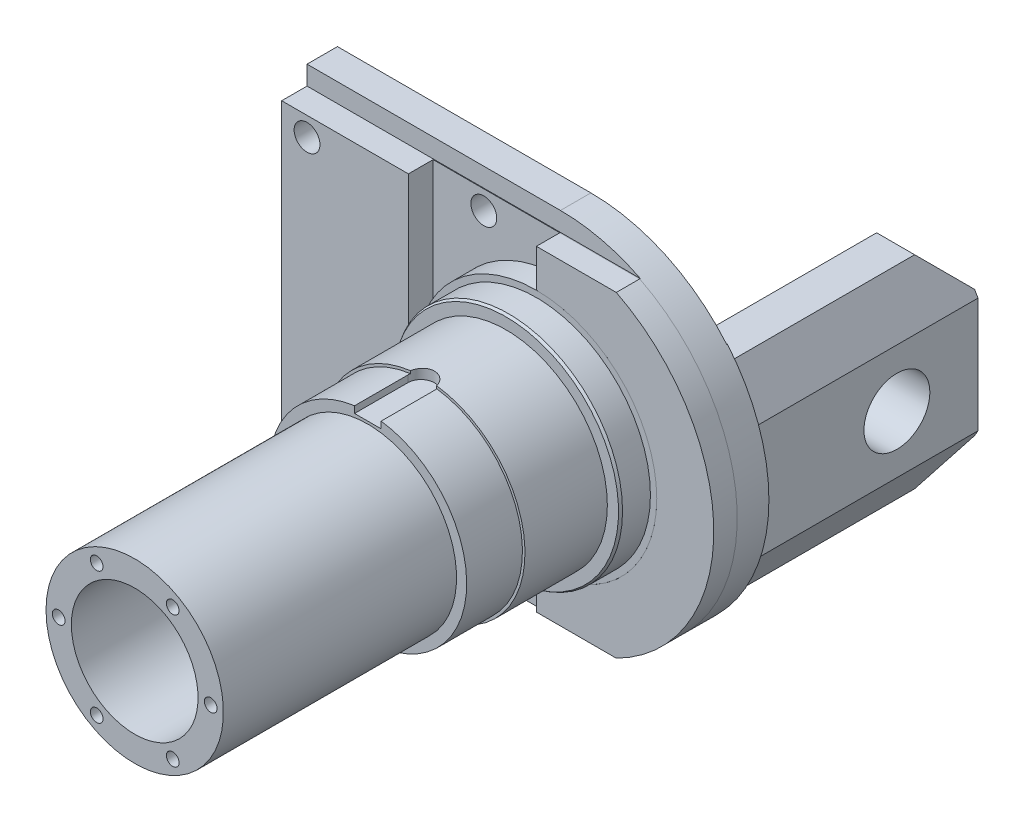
ISO-10303-21;
HEADER;
FILE_DESCRIPTION(('STEP AP214'),'2;1');
FILE_NAME('part.step','',(''),(''),'','','');
FILE_SCHEMA(('AUTOMOTIVE_DESIGN { 1 0 10303 214 1 1 1 1 }'));
ENDSEC;
DATA;
#1=APPLICATION_CONTEXT('core data for automotive mechanical design processes');
#2=APPLICATION_PROTOCOL_DEFINITION('international standard','automotive_design',2000,#1);
#3=PRODUCT_CONTEXT('',#1,'mechanical');
#4=PRODUCT('Part','Part','',(#3));
#5=PRODUCT_RELATED_PRODUCT_CATEGORY('part','',(#4));
#6=PRODUCT_DEFINITION_FORMATION('','',#4);
#7=PRODUCT_DEFINITION_CONTEXT('part definition',#1,'design');
#8=PRODUCT_DEFINITION('design','',#6,#7);
#9=PRODUCT_DEFINITION_SHAPE('','',#8);
#10=(LENGTH_UNIT() NAMED_UNIT(*) SI_UNIT(.MILLI.,.METRE.));
#11=(NAMED_UNIT(*) PLANE_ANGLE_UNIT() SI_UNIT($,.RADIAN.));
#12=(NAMED_UNIT(*) SI_UNIT($,.STERADIAN.) SOLID_ANGLE_UNIT());
#13=UNCERTAINTY_MEASURE_WITH_UNIT(LENGTH_MEASURE(1.E-05),#10,'distance_accuracy_value','');
#14=(GEOMETRIC_REPRESENTATION_CONTEXT(3) GLOBAL_UNCERTAINTY_ASSIGNED_CONTEXT((#13)) GLOBAL_UNIT_ASSIGNED_CONTEXT((#10,
#11,#12)) REPRESENTATION_CONTEXT('',''));
#15=CARTESIAN_POINT('',(0.,0.,0.));
#16=DIRECTION('',(0.,0.,1.));
#17=DIRECTION('',(1.,0.,0.));
#18=AXIS2_PLACEMENT_3D('',#15,#16,#17);
#19=CARTESIAN_POINT('',(0.,0.,164.765487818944));
#20=DIRECTION('',(0.,0.,-1.));
#21=DIRECTION('',(-1.,0.,0.));
#22=AXIS2_PLACEMENT_3D('',#19,#20,#21);
#23=CYLINDRICAL_SURFACE('',#22,70.);
#24=CARTESIAN_POINT('',(0.,0.,21.5));
#25=DIRECTION('',(0.,0.,1.));
#26=DIRECTION('',(1.,0.,0.));
#27=AXIS2_PLACEMENT_3D('',#24,#25,#26);
#28=CIRCLE('',#27,70.);
#29=CARTESIAN_POINT('',(31.5238005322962,-62.5,21.5));
#30=VERTEX_POINT('',#29);
#31=CARTESIAN_POINT('',(31.5238005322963,62.5,21.5));
#32=VERTEX_POINT('',#31);
#33=EDGE_CURVE('E127',#30,#32,#28,.T.);
#34=ORIENTED_EDGE('',*,*,#33,.F.);
#35=DIRECTION('',(0.,0.,-1.));
#36=VECTOR('',#35,1.);
#37=CARTESIAN_POINT('',(31.5238005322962,-62.5,164.765487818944));
#38=LINE('',#37,#36);
#39=CARTESIAN_POINT('',(31.5238005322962,-62.5,12.25));
#40=VERTEX_POINT('',#39);
#41=EDGE_CURVE('E50',#30,#40,#38,.T.);
#42=ORIENTED_EDGE('',*,*,#41,.T.);
#43=CARTESIAN_POINT('',(0.,0.,12.25));
#44=DIRECTION('',(0.,0.,1.));
#45=DIRECTION('',(1.,0.,0.));
#46=AXIS2_PLACEMENT_3D('',#43,#44,#45);
#47=CIRCLE('',#46,70.);
#48=CARTESIAN_POINT('',(31.5238005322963,62.5,12.25));
#49=VERTEX_POINT('',#48);
#50=EDGE_CURVE('E135',#40,#49,#47,.T.);
#51=ORIENTED_EDGE('',*,*,#50,.T.);
#52=DIRECTION('',(0.,0.,-1.));
#53=VECTOR('',#52,1.);
#54=CARTESIAN_POINT('',(31.5238005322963,62.5,164.765487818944));
#55=LINE('',#54,#53);
#56=EDGE_CURVE('E93',#32,#49,#55,.T.);
#57=ORIENTED_EDGE('',*,*,#56,.F.);
#58=EDGE_LOOP('',(#34,#42,#51,#57));
#59=FACE_BOUND('',#58,.T.);
#60=ADVANCED_FACE('F46',(#59),#23,.T.);
#61=CARTESIAN_POINT('',(31.5238005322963,62.5,164.765487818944));
#62=DIRECTION('',(0.,-1.,0.));
#63=DIRECTION('',(0.,0.,-1.));
#64=AXIS2_PLACEMENT_3D('',#61,#62,#63);
#65=PLANE('',#64);
#66=DIRECTION('',(-1.,0.,0.));
#67=VECTOR('',#66,1.);
#68=CARTESIAN_POINT('',(31.5238005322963,62.5,21.5));
#69=LINE('',#68,#67);
#70=CARTESIAN_POINT('',(0.,62.5,21.5));
#71=VERTEX_POINT('',#70);
#72=EDGE_CURVE('E100',#32,#71,#69,.T.);
#73=ORIENTED_EDGE('',*,*,#72,.F.);
#74=ORIENTED_EDGE('',*,*,#56,.T.);
#75=DIRECTION('',(-1.,0.,0.));
#76=VECTOR('',#75,1.);
#77=CARTESIAN_POINT('',(31.5238005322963,62.5,12.25));
#78=LINE('',#77,#76);
#79=CARTESIAN_POINT('',(0.,62.5,12.25));
#80=VERTEX_POINT('',#79);
#81=EDGE_CURVE('E134',#49,#80,#78,.T.);
#82=ORIENTED_EDGE('',*,*,#81,.T.);
#83=DIRECTION('',(0.,0.,-1.));
#84=VECTOR('',#83,1.);
#85=CARTESIAN_POINT('',(0.,62.5,164.765487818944));
#86=LINE('',#85,#84);
#87=EDGE_CURVE('E136',#71,#80,#86,.T.);
#88=ORIENTED_EDGE('',*,*,#87,.F.);
#89=EDGE_LOOP('',(#73,#74,#82,#88));
#90=FACE_BOUND('',#89,.T.);
#91=ADVANCED_FACE('F154',(#90),#65,.F.);
#92=CARTESIAN_POINT('',(0.,62.5,164.765487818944));
#93=DIRECTION('',(1.,0.,0.));
#94=DIRECTION('',(0.,0.,-1.));
#95=AXIS2_PLACEMENT_3D('',#92,#93,#94);
#96=PLANE('',#95);
#97=DIRECTION('',(0.,-1.,0.));
#98=VECTOR('',#97,1.);
#99=CARTESIAN_POINT('',(0.,62.5,21.5));
#100=LINE('',#99,#98);
#101=CARTESIAN_POINT('',(0.,47.5,21.5));
#102=VERTEX_POINT('',#101);
#103=EDGE_CURVE('E121',#71,#102,#100,.T.);
#104=ORIENTED_EDGE('',*,*,#103,.F.);
#105=ORIENTED_EDGE('',*,*,#87,.T.);
#106=DIRECTION('',(0.,-1.,0.));
#107=VECTOR('',#106,1.);
#108=CARTESIAN_POINT('',(0.,62.5,12.25));
#109=LINE('',#108,#107);
#110=CARTESIAN_POINT('',(0.,47.5,12.25));
#111=VERTEX_POINT('',#110);
#112=EDGE_CURVE('E138',#80,#111,#109,.T.);
#113=ORIENTED_EDGE('',*,*,#112,.T.);
#114=DIRECTION('',(0.,0.,-1.));
#115=VECTOR('',#114,1.);
#116=CARTESIAN_POINT('',(0.,47.5,164.765487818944));
#117=LINE('',#116,#115);
#118=EDGE_CURVE('E139',#102,#111,#117,.T.);
#119=ORIENTED_EDGE('',*,*,#118,.F.);
#120=EDGE_LOOP('',(#104,#105,#113,#119));
#121=FACE_BOUND('',#120,.T.);
#122=ADVANCED_FACE('F156',(#121),#96,.F.);
#123=CARTESIAN_POINT('',(0.,0.,164.765487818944));
#124=DIRECTION('',(0.,0.,-1.));
#125=DIRECTION('',(-1.,0.,0.));
#126=AXIS2_PLACEMENT_3D('',#123,#124,#125);
#127=CYLINDRICAL_SURFACE('',#126,47.5);
#128=CARTESIAN_POINT('',(0.,0.,21.5));
#129=DIRECTION('',(0.,0.,1.));
#130=DIRECTION('',(1.,0.,0.));
#131=AXIS2_PLACEMENT_3D('',#128,#129,#130);
#132=CIRCLE('',#131,47.5);
#133=CARTESIAN_POINT('',(0.,-47.5,21.5));
#134=VERTEX_POINT('',#133);
#135=EDGE_CURVE('E55',#102,#134,#132,.F.);
#136=ORIENTED_EDGE('',*,*,#135,.F.);
#137=ORIENTED_EDGE('',*,*,#118,.T.);
#138=CARTESIAN_POINT('',(0.,0.,12.25));
#139=DIRECTION('',(0.,0.,-1.));
#140=DIRECTION('',(1.,0.,0.));
#141=AXIS2_PLACEMENT_3D('',#138,#139,#140);
#142=CIRCLE('',#141,47.5);
#143=CARTESIAN_POINT('',(0.,-47.5,12.25));
#144=VERTEX_POINT('',#143);
#145=EDGE_CURVE('E116',#111,#144,#142,.T.);
#146=ORIENTED_EDGE('',*,*,#145,.T.);
#147=DIRECTION('',(0.,0.,-1.));
#148=VECTOR('',#147,1.);
#149=CARTESIAN_POINT('',(0.,-47.5,164.765487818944));
#150=LINE('',#149,#148);
#151=EDGE_CURVE('E107',#134,#144,#150,.T.);
#152=ORIENTED_EDGE('',*,*,#151,.F.);
#153=EDGE_LOOP('',(#136,#137,#146,#152));
#154=FACE_BOUND('',#153,.T.);
#155=ADVANCED_FACE('F113',(#154),#127,.F.);
#156=CARTESIAN_POINT('',(0.,-47.5,164.765487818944));
#157=DIRECTION('',(1.,0.,0.));
#158=DIRECTION('',(0.,0.,-1.));
#159=AXIS2_PLACEMENT_3D('',#156,#157,#158);
#160=PLANE('',#159);
#161=DIRECTION('',(0.,-1.,0.));
#162=VECTOR('',#161,1.);
#163=CARTESIAN_POINT('',(0.,-47.5,21.5));
#164=LINE('',#163,#162);
#165=CARTESIAN_POINT('',(0.,-62.5,21.5));
#166=VERTEX_POINT('',#165);
#167=EDGE_CURVE('E12',#134,#166,#164,.T.);
#168=ORIENTED_EDGE('',*,*,#167,.F.);
#169=ORIENTED_EDGE('',*,*,#151,.T.);
#170=DIRECTION('',(0.,-1.,0.));
#171=VECTOR('',#170,1.);
#172=CARTESIAN_POINT('',(0.,-47.5,12.25));
#173=LINE('',#172,#171);
#174=CARTESIAN_POINT('',(0.,-62.5,12.25));
#175=VERTEX_POINT('',#174);
#176=EDGE_CURVE('E118',#144,#175,#173,.T.);
#177=ORIENTED_EDGE('',*,*,#176,.T.);
#178=DIRECTION('',(0.,0.,-1.));
#179=VECTOR('',#178,1.);
#180=CARTESIAN_POINT('',(0.,-62.5,164.765487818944));
#181=LINE('',#180,#179);
#182=EDGE_CURVE('E68',#166,#175,#181,.T.);
#183=ORIENTED_EDGE('',*,*,#182,.F.);
#184=EDGE_LOOP('',(#168,#169,#177,#183));
#185=FACE_BOUND('',#184,.T.);
#186=ADVANCED_FACE('F106',(#185),#160,.F.);
#187=CARTESIAN_POINT('',(0.,-62.5,164.765487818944));
#188=DIRECTION('',(0.,1.,0.));
#189=DIRECTION('',(0.,0.,1.));
#190=AXIS2_PLACEMENT_3D('',#187,#188,#189);
#191=PLANE('',#190);
#192=DIRECTION('',(1.,0.,0.));
#193=VECTOR('',#192,1.);
#194=CARTESIAN_POINT('',(0.,-62.5,21.5));
#195=LINE('',#194,#193);
#196=EDGE_CURVE('E130',#166,#30,#195,.T.);
#197=ORIENTED_EDGE('',*,*,#196,.F.);
#198=ORIENTED_EDGE('',*,*,#182,.T.);
#199=DIRECTION('',(1.,0.,0.));
#200=VECTOR('',#199,1.);
#201=CARTESIAN_POINT('',(0.,-62.5,12.25));
#202=LINE('',#201,#200);
#203=EDGE_CURVE('E132',#175,#40,#202,.T.);
#204=ORIENTED_EDGE('',*,*,#203,.T.);
#205=ORIENTED_EDGE('',*,*,#41,.F.);
#206=EDGE_LOOP('',(#197,#198,#204,#205));
#207=FACE_BOUND('',#206,.T.);
#208=ADVANCED_FACE('F150',(#207),#191,.F.);
#209=CARTESIAN_POINT('',(0.,0.,12.25));
#210=DIRECTION('',(0.,0.,1.));
#211=DIRECTION('',(1.,0.,0.));
#212=AXIS2_PLACEMENT_3D('',#209,#210,#211);
#213=PLANE('',#212);
#214=ORIENTED_EDGE('',*,*,#50,.F.);
#215=ORIENTED_EDGE('',*,*,#203,.F.);
#216=ORIENTED_EDGE('',*,*,#176,.F.);
#217=ORIENTED_EDGE('',*,*,#145,.F.);
#218=ORIENTED_EDGE('',*,*,#112,.F.);
#219=ORIENTED_EDGE('',*,*,#81,.F.);
#220=EDGE_LOOP('',(#214,#215,#216,#217,#218,#219));
#221=FACE_BOUND('',#220,.T.);
#222=ADVANCED_FACE('F152',(#221),#213,.F.);
#223=CARTESIAN_POINT('',(0.,0.,21.5));
#224=DIRECTION('',(0.,0.,1.));
#225=DIRECTION('',(1.,0.,0.));
#226=AXIS2_PLACEMENT_3D('',#223,#224,#225);
#227=PLANE('',#226);
#228=ORIENTED_EDGE('',*,*,#196,.T.);
#229=ORIENTED_EDGE('',*,*,#33,.T.);
#230=ORIENTED_EDGE('',*,*,#72,.T.);
#231=ORIENTED_EDGE('',*,*,#103,.T.);
#232=ORIENTED_EDGE('',*,*,#135,.T.);
#233=ORIENTED_EDGE('',*,*,#167,.T.);
#234=EDGE_LOOP('',(#228,#229,#230,#231,#232,#233));
#235=FACE_BOUND('',#234,.T.);
#236=ADVANCED_FACE('F48',(#235),#227,.T.);
#237=CLOSED_SHELL('',(#60,#91,#122,#155,#186,#208,#222,#236));
#238=MANIFOLD_SOLID_BREP('B2',#237);
#239=CARTESIAN_POINT('',(65.,22.6794919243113,-87.75));
#240=DIRECTION('',(-0.866025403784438,-0.500000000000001,0.));
#241=DIRECTION('',(0.500000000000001,-0.866025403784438,0.));
#242=AXIS2_PLACEMENT_3D('',#239,#240,#241);
#243=PLANE('',#242);
#244=DIRECTION('',(0.500000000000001,-0.866025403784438,0.));
#245=VECTOR('',#244,1.);
#246=CARTESIAN_POINT('',(65.,22.6794919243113,-87.75));
#247=LINE('',#246,#245);
#248=CARTESIAN_POINT('',(63.6602540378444,25.,-87.75));
#249=VERTEX_POINT('',#248);
#250=CARTESIAN_POINT('',(65.,22.6794919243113,-87.75));
#251=VERTEX_POINT('',#250);
#252=EDGE_CURVE('E334',#249,#251,#247,.T.);
#253=ORIENTED_EDGE('',*,*,#252,.F.);
#254=DIRECTION('',(-0.377964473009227,0.654653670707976,0.654653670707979));
#255=VECTOR('',#254,1.);
#256=CARTESIAN_POINT('',(65.7222192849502,21.4285714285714,-91.3214285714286));
#257=LINE('',#256,#255);
#258=CARTESIAN_POINT('',(55.,40.,-72.7499999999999));
#259=VERTEX_POINT('',#258);
#260=EDGE_CURVE('E239',#249,#259,#257,.T.);
#261=ORIENTED_EDGE('',*,*,#260,.T.);
#262=DIRECTION('',(0.,0.,1.));
#263=VECTOR('',#262,1.);
#264=CARTESIAN_POINT('',(55.,40.,-87.75));
#265=LINE('',#264,#263);
#266=CARTESIAN_POINT('',(55.,40.,-0.25));
#267=VERTEX_POINT('',#266);
#268=EDGE_CURVE('E316',#259,#267,#265,.T.);
#269=ORIENTED_EDGE('',*,*,#268,.T.);
#270=DIRECTION('',(0.500000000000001,-0.866025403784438,0.));
#271=VECTOR('',#270,1.);
#272=CARTESIAN_POINT('',(65.,22.6794919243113,-0.25));
#273=LINE('',#272,#271);
#274=CARTESIAN_POINT('',(65.,22.6794919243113,-0.25));
#275=VERTEX_POINT('',#274);
#276=EDGE_CURVE('E300',#267,#275,#273,.T.);
#277=ORIENTED_EDGE('',*,*,#276,.T.);
#278=DIRECTION('',(0.,0.,1.));
#279=VECTOR('',#278,1.);
#280=CARTESIAN_POINT('',(65.,22.6794919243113,-87.75));
#281=LINE('',#280,#279);
#282=EDGE_CURVE('E310',#251,#275,#281,.T.);
#283=ORIENTED_EDGE('',*,*,#282,.F.);
#284=EDGE_LOOP('',(#253,#261,#269,#277,#283));
#285=FACE_BOUND('',#284,.T.);
#286=ADVANCED_FACE('F232',(#285),#243,.F.);
#287=CARTESIAN_POINT('',(65.,-22.6794919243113,-87.75));
#288=DIRECTION('',(-1.,0.,0.));
#289=DIRECTION('',(0.,0.,1.));
#290=AXIS2_PLACEMENT_3D('',#287,#288,#289);
#291=PLANE('',#290);
#292=CARTESIAN_POINT('',(65.,0.,-55.75));
#293=DIRECTION('',(1.,0.,0.));
#294=DIRECTION('',(0.,1.,0.));
#295=AXIS2_PLACEMENT_3D('',#292,#293,#294);
#296=CIRCLE('',#295,13.);
#297=CARTESIAN_POINT('',(65.,13.,-55.75));
#298=VERTEX_POINT('',#297);
#299=EDGE_CURVE('E321',#298,#298,#296,.T.);
#300=ORIENTED_EDGE('',*,*,#299,.F.);
#301=EDGE_LOOP('',(#300));
#302=FACE_BOUND('',#301,.T.);
#303=DIRECTION('',(0.,-1.,0.));
#304=VECTOR('',#303,1.);
#305=CARTESIAN_POINT('',(65.,-22.6794919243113,-0.25));
#306=LINE('',#305,#304);
#307=CARTESIAN_POINT('',(65.,-22.6794919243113,-0.25));
#308=VERTEX_POINT('',#307);
#309=EDGE_CURVE('E295',#275,#308,#306,.T.);
#310=ORIENTED_EDGE('',*,*,#309,.T.);
#311=DIRECTION('',(0.,0.,1.));
#312=VECTOR('',#311,1.);
#313=CARTESIAN_POINT('',(65.,-22.6794919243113,-87.75));
#314=LINE('',#313,#312);
#315=CARTESIAN_POINT('',(65.,-22.6794919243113,-87.75));
#316=VERTEX_POINT('',#315);
#317=EDGE_CURVE('E314',#316,#308,#314,.T.);
#318=ORIENTED_EDGE('',*,*,#317,.F.);
#319=DIRECTION('',(0.,-1.,0.));
#320=VECTOR('',#319,1.);
#321=CARTESIAN_POINT('',(65.,-22.6794919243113,-87.75));
#322=LINE('',#321,#320);
#323=EDGE_CURVE('E312',#251,#316,#322,.T.);
#324=ORIENTED_EDGE('',*,*,#323,.F.);
#325=ORIENTED_EDGE('',*,*,#282,.T.);
#326=EDGE_LOOP('',(#310,#318,#324,#325));
#327=FACE_BOUND('',#326,.T.);
#328=ADVANCED_FACE('F311',(#302,#327),#291,.F.);
#329=CARTESIAN_POINT('',(55.,-40.,-87.75));
#330=DIRECTION('',(-0.866025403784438,0.500000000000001,0.));
#331=DIRECTION('',(-0.500000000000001,-0.866025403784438,0.));
#332=AXIS2_PLACEMENT_3D('',#329,#330,#331);
#333=PLANE('',#332);
#334=DIRECTION('',(0.,0.,1.));
#335=VECTOR('',#334,1.);
#336=CARTESIAN_POINT('',(55.,-40.,-87.75));
#337=LINE('',#336,#335);
#338=CARTESIAN_POINT('',(55.,-40.,-72.75));
#339=VERTEX_POINT('',#338);
#340=CARTESIAN_POINT('',(55.,-40.,-0.25));
#341=VERTEX_POINT('',#340);
#342=EDGE_CURVE('E348',#339,#341,#337,.T.);
#343=ORIENTED_EDGE('',*,*,#342,.F.);
#344=DIRECTION('',(0.377964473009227,0.654653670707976,-0.654653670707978));
#345=VECTOR('',#344,1.);
#346=CARTESIAN_POINT('',(65.7222192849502,-21.4285714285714,-91.3214285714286));
#347=LINE('',#346,#345);
#348=CARTESIAN_POINT('',(63.6602540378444,-25.,-87.75));
#349=VERTEX_POINT('',#348);
#350=EDGE_CURVE('E361',#339,#349,#347,.T.);
#351=ORIENTED_EDGE('',*,*,#350,.T.);
#352=DIRECTION('',(-0.500000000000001,-0.866025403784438,0.));
#353=VECTOR('',#352,1.);
#354=CARTESIAN_POINT('',(55.,-40.,-87.75));
#355=LINE('',#354,#353);
#356=EDGE_CURVE('E337',#316,#349,#355,.T.);
#357=ORIENTED_EDGE('',*,*,#356,.F.);
#358=ORIENTED_EDGE('',*,*,#317,.T.);
#359=DIRECTION('',(-0.500000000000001,-0.866025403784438,0.));
#360=VECTOR('',#359,1.);
#361=CARTESIAN_POINT('',(55.,-40.,-0.25));
#362=LINE('',#361,#360);
#363=EDGE_CURVE('E303',#308,#341,#362,.T.);
#364=ORIENTED_EDGE('',*,*,#363,.T.);
#365=EDGE_LOOP('',(#343,#351,#357,#358,#364));
#366=FACE_BOUND('',#365,.T.);
#367=ADVANCED_FACE('F365',(#366),#333,.F.);
#368=CARTESIAN_POINT('',(40.,-40.,-87.75));
#369=DIRECTION('',(0.,1.,0.));
#370=DIRECTION('',(0.,0.,1.));
#371=AXIS2_PLACEMENT_3D('',#368,#369,#370);
#372=PLANE('',#371);
#373=DIRECTION('',(0.,0.,1.));
#374=VECTOR('',#373,1.);
#375=CARTESIAN_POINT('',(40.,-40.,-87.75));
#376=LINE('',#375,#374);
#377=CARTESIAN_POINT('',(40.,-40.,-72.7499999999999));
#378=VERTEX_POINT('',#377);
#379=CARTESIAN_POINT('',(40.,-40.,-0.25));
#380=VERTEX_POINT('',#379);
#381=EDGE_CURVE('E346',#378,#380,#376,.T.);
#382=ORIENTED_EDGE('',*,*,#381,.F.);
#383=DIRECTION('',(1.,0.,0.));
#384=VECTOR('',#383,1.);
#385=CARTESIAN_POINT('',(55.,-40.,-72.7499999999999));
#386=LINE('',#385,#384);
#387=EDGE_CURVE('E253',#378,#339,#386,.T.);
#388=ORIENTED_EDGE('',*,*,#387,.T.);
#389=ORIENTED_EDGE('',*,*,#342,.T.);
#390=DIRECTION('',(-1.,0.,0.));
#391=VECTOR('',#390,1.);
#392=CARTESIAN_POINT('',(40.,-40.,-0.25));
#393=LINE('',#392,#391);
#394=EDGE_CURVE('E326',#341,#380,#393,.T.);
#395=ORIENTED_EDGE('',*,*,#394,.T.);
#396=EDGE_LOOP('',(#382,#388,#389,#395));
#397=FACE_BOUND('',#396,.T.);
#398=ADVANCED_FACE('F374',(#397),#372,.F.);
#399=CARTESIAN_POINT('',(40.,40.,-87.75));
#400=DIRECTION('',(1.,0.,0.));
#401=DIRECTION('',(0.,1.,0.));
#402=AXIS2_PLACEMENT_3D('',#399,#400,#401);
#403=PLANE('',#402);
#404=CARTESIAN_POINT('',(40.,0.,-55.75));
#405=DIRECTION('',(1.,0.,0.));
#406=DIRECTION('',(0.,1.,0.));
#407=AXIS2_PLACEMENT_3D('',#404,#405,#406);
#408=CIRCLE('',#407,13.);
#409=CARTESIAN_POINT('',(40.,13.,-55.75));
#410=VERTEX_POINT('',#409);
#411=EDGE_CURVE('E318',#410,#410,#408,.F.);
#412=ORIENTED_EDGE('',*,*,#411,.F.);
#413=EDGE_LOOP('',(#412));
#414=FACE_BOUND('',#413,.T.);
#415=DIRECTION('',(0.,1.,0.));
#416=VECTOR('',#415,1.);
#417=CARTESIAN_POINT('',(40.,40.,-87.75));
#418=LINE('',#417,#416);
#419=CARTESIAN_POINT('',(40.,-25.,-87.75));
#420=VERTEX_POINT('',#419);
#421=CARTESIAN_POINT('',(40.,25.,-87.75));
#422=VERTEX_POINT('',#421);
#423=EDGE_CURVE('E340',#420,#422,#418,.T.);
#424=ORIENTED_EDGE('',*,*,#423,.F.);
#425=DIRECTION('',(0.,-0.707106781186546,0.707106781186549));
#426=VECTOR('',#425,1.);
#427=CARTESIAN_POINT('',(40.,-25.,-87.75));
#428=LINE('',#427,#426);
#429=EDGE_CURVE('E358',#420,#378,#428,.T.);
#430=ORIENTED_EDGE('',*,*,#429,.T.);
#431=ORIENTED_EDGE('',*,*,#381,.T.);
#432=DIRECTION('',(0.,1.,0.));
#433=VECTOR('',#432,1.);
#434=CARTESIAN_POINT('',(40.,40.,-0.25));
#435=LINE('',#434,#433);
#436=CARTESIAN_POINT('',(40.,40.,-0.25));
#437=VERTEX_POINT('',#436);
#438=EDGE_CURVE('E329',#380,#437,#435,.T.);
#439=ORIENTED_EDGE('',*,*,#438,.T.);
#440=DIRECTION('',(0.,0.,1.));
#441=VECTOR('',#440,1.);
#442=CARTESIAN_POINT('',(40.,40.,-87.75));
#443=LINE('',#442,#441);
#444=CARTESIAN_POINT('',(40.,40.,-72.7499999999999));
#445=VERTEX_POINT('',#444);
#446=EDGE_CURVE('E344',#445,#437,#443,.T.);
#447=ORIENTED_EDGE('',*,*,#446,.F.);
#448=DIRECTION('',(0.,-0.707106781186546,-0.707106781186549));
#449=VECTOR('',#448,1.);
#450=CARTESIAN_POINT('',(40.,25.,-87.75));
#451=LINE('',#450,#449);
#452=EDGE_CURVE('E356',#445,#422,#451,.T.);
#453=ORIENTED_EDGE('',*,*,#452,.T.);
#454=EDGE_LOOP('',(#424,#430,#431,#439,#447,#453));
#455=FACE_BOUND('',#454,.T.);
#456=ADVANCED_FACE('F373',(#414,#455),#403,.F.);
#457=CARTESIAN_POINT('',(55.,40.,-87.75));
#458=DIRECTION('',(0.,-1.,0.));
#459=DIRECTION('',(0.,0.,-1.));
#460=AXIS2_PLACEMENT_3D('',#457,#458,#459);
#461=PLANE('',#460);
#462=ORIENTED_EDGE('',*,*,#268,.F.);
#463=DIRECTION('',(-1.,0.,0.));
#464=VECTOR('',#463,1.);
#465=CARTESIAN_POINT('',(40.,40.,-72.7499999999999));
#466=LINE('',#465,#464);
#467=EDGE_CURVE('E44',#259,#445,#466,.T.);
#468=ORIENTED_EDGE('',*,*,#467,.T.);
#469=ORIENTED_EDGE('',*,*,#446,.T.);
#470=DIRECTION('',(1.,0.,0.));
#471=VECTOR('',#470,1.);
#472=CARTESIAN_POINT('',(55.,40.,-0.25));
#473=LINE('',#472,#471);
#474=EDGE_CURVE('E332',#437,#267,#473,.T.);
#475=ORIENTED_EDGE('',*,*,#474,.T.);
#476=EDGE_LOOP('',(#462,#468,#469,#475));
#477=FACE_BOUND('',#476,.T.);
#478=ADVANCED_FACE('F383',(#477),#461,.F.);
#479=CARTESIAN_POINT('',(78.0940107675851,0.,-87.75));
#480=DIRECTION('',(0.,0.,-1.));
#481=DIRECTION('',(-1.,0.,0.));
#482=AXIS2_PLACEMENT_3D('',#479,#480,#481);
#483=PLANE('',#482);
#484=ORIENTED_EDGE('',*,*,#356,.T.);
#485=DIRECTION('',(-1.,0.,0.));
#486=VECTOR('',#485,1.);
#487=CARTESIAN_POINT('',(40.,-25.,-87.75));
#488=LINE('',#487,#486);
#489=EDGE_CURVE('E353',#349,#420,#488,.T.);
#490=ORIENTED_EDGE('',*,*,#489,.T.);
#491=ORIENTED_EDGE('',*,*,#423,.T.);
#492=DIRECTION('',(1.,0.,0.));
#493=VECTOR('',#492,1.);
#494=CARTESIAN_POINT('',(55.,25.,-87.75));
#495=LINE('',#494,#493);
#496=EDGE_CURVE('E313',#422,#249,#495,.T.);
#497=ORIENTED_EDGE('',*,*,#496,.T.);
#498=ORIENTED_EDGE('',*,*,#252,.T.);
#499=ORIENTED_EDGE('',*,*,#323,.T.);
#500=EDGE_LOOP('',(#484,#490,#491,#497,#498,#499));
#501=FACE_BOUND('',#500,.T.);
#502=ADVANCED_FACE('F369',(#501),#483,.T.);
#503=CARTESIAN_POINT('',(78.0940107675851,0.,-0.25));
#504=DIRECTION('',(0.,0.,-1.));
#505=DIRECTION('',(-1.,0.,0.));
#506=AXIS2_PLACEMENT_3D('',#503,#504,#505);
#507=PLANE('',#506);
#508=ORIENTED_EDGE('',*,*,#276,.F.);
#509=ORIENTED_EDGE('',*,*,#474,.F.);
#510=ORIENTED_EDGE('',*,*,#438,.F.);
#511=ORIENTED_EDGE('',*,*,#394,.F.);
#512=ORIENTED_EDGE('',*,*,#363,.F.);
#513=ORIENTED_EDGE('',*,*,#309,.F.);
#514=EDGE_LOOP('',(#508,#509,#510,#511,#512,#513));
#515=FACE_BOUND('',#514,.T.);
#516=ADVANCED_FACE('F297',(#515),#507,.F.);
#517=CARTESIAN_POINT('',(-100.00105,0.,-55.75));
#518=DIRECTION('',(1.,0.,0.));
#519=DIRECTION('',(0.,1.,0.));
#520=AXIS2_PLACEMENT_3D('',#517,#518,#519);
#521=CYLINDRICAL_SURFACE('',#520,13.);
#522=ORIENTED_EDGE('',*,*,#299,.T.);
#523=EDGE_LOOP('',(#522));
#524=FACE_BOUND('',#523,.T.);
#525=ORIENTED_EDGE('',*,*,#411,.T.);
#526=EDGE_LOOP('',(#525));
#527=FACE_BOUND('',#526,.T.);
#528=ADVANCED_FACE('F434',(#524,#527),#521,.F.);
#529=CARTESIAN_POINT('',(78.0940107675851,-25.,-87.75));
#530=DIRECTION('',(0.,-0.707106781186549,-0.707106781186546));
#531=DIRECTION('',(0.,0.707106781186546,-0.707106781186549));
#532=AXIS2_PLACEMENT_3D('',#529,#530,#531);
#533=PLANE('',#532);
#534=ORIENTED_EDGE('',*,*,#350,.F.);
#535=ORIENTED_EDGE('',*,*,#387,.F.);
#536=ORIENTED_EDGE('',*,*,#429,.F.);
#537=ORIENTED_EDGE('',*,*,#489,.F.);
#538=EDGE_LOOP('',(#534,#535,#536,#537));
#539=FACE_BOUND('',#538,.T.);
#540=ADVANCED_FACE('F371',(#539),#533,.T.);
#541=CARTESIAN_POINT('',(78.0940107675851,25.,-87.75));
#542=DIRECTION('',(0.,0.707106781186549,-0.707106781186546));
#543=DIRECTION('',(0.,0.707106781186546,0.707106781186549));
#544=AXIS2_PLACEMENT_3D('',#541,#542,#543);
#545=PLANE('',#544);
#546=ORIENTED_EDGE('',*,*,#452,.F.);
#547=ORIENTED_EDGE('',*,*,#467,.F.);
#548=ORIENTED_EDGE('',*,*,#260,.F.);
#549=ORIENTED_EDGE('',*,*,#496,.F.);
#550=EDGE_LOOP('',(#546,#547,#548,#549));
#551=FACE_BOUND('',#550,.T.);
#552=ADVANCED_FACE('F382',(#551),#545,.T.);
#553=CLOSED_SHELL('',(#286,#328,#367,#398,#456,#478,#502,#516,#528,#540,#552));
#554=MANIFOLD_SOLID_BREP('B6',#553);
#555=CARTESIAN_POINT('',(25.,0.,0.));
#556=DIRECTION('',(0.,0.,1.));
#557=DIRECTION('',(1.,0.,0.));
#558=AXIS2_PLACEMENT_3D('',#555,#556,#557);
#559=PLANE('',#558);
#560=DIRECTION('',(1.,0.,0.));
#561=VECTOR('',#560,1.);
#562=CARTESIAN_POINT('',(15.2069063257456,45.,0.));
#563=LINE('',#562,#561);
#564=CARTESIAN_POINT('',(-15.2069063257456,45.,0.));
#565=VERTEX_POINT('',#564);
#566=CARTESIAN_POINT('',(15.2069063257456,45.,0.));
#567=VERTEX_POINT('',#566);
#568=EDGE_CURVE('E597',#565,#567,#563,.T.);
#569=ORIENTED_EDGE('',*,*,#568,.F.);
#570=CARTESIAN_POINT('',(0.,0.,0.));
#571=DIRECTION('',(0.,0.,-1.));
#572=DIRECTION('',(-1.,0.,0.));
#573=AXIS2_PLACEMENT_3D('',#570,#571,#572);
#574=CIRCLE('',#573,47.5);
#575=EDGE_CURVE('E512',#565,#567,#574,.T.);
#576=ORIENTED_EDGE('',*,*,#575,.T.);
#577=EDGE_LOOP('',(#569,#576));
#578=FACE_BOUND('',#577,.T.);
#579=ADVANCED_FACE('F490',(#578),#559,.F.);
#580=DIRECTION('',(-1.,0.,0.));
#581=VECTOR('',#580,1.);
#582=CARTESIAN_POINT('',(15.2069063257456,-45.,0.));
#583=LINE('',#582,#581);
#584=CARTESIAN_POINT('',(15.2069063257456,-45.,0.));
#585=VERTEX_POINT('',#584);
#586=CARTESIAN_POINT('',(-15.2069063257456,-45.,0.));
#587=VERTEX_POINT('',#586);
#588=EDGE_CURVE('E505',#585,#587,#583,.T.);
#589=ORIENTED_EDGE('',*,*,#588,.F.);
#590=EDGE_CURVE('E583',#585,#587,#574,.T.);
#591=ORIENTED_EDGE('',*,*,#590,.T.);
#592=EDGE_LOOP('',(#589,#591));
#593=FACE_BOUND('',#592,.T.);
#594=ADVANCED_FACE('F584',(#593),#559,.F.);
#595=CARTESIAN_POINT('',(0.,0.,0.));
#596=DIRECTION('',(0.,0.,-1.));
#597=DIRECTION('',(-1.,0.,0.));
#598=AXIS2_PLACEMENT_3D('',#595,#596,#597);
#599=CYLINDRICAL_SURFACE('',#598,47.5);
#600=ORIENTED_EDGE('',*,*,#575,.F.);
#601=DIRECTION('',(0.,0.,1.));
#602=VECTOR('',#601,1.);
#603=CARTESIAN_POINT('',(-15.2069063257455,45.,-0.25));
#604=LINE('',#603,#602);
#605=CARTESIAN_POINT('',(-15.2069063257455,45.,-0.25));
#606=VERTEX_POINT('',#605);
#607=EDGE_CURVE('E604',#606,#565,#604,.T.);
#608=ORIENTED_EDGE('',*,*,#607,.F.);
#609=CARTESIAN_POINT('',(0.,0.,-0.25));
#610=DIRECTION('',(0.,0.,-1.));
#611=DIRECTION('',(-1.,0.,0.));
#612=AXIS2_PLACEMENT_3D('',#609,#610,#611);
#613=CIRCLE('',#612,47.5);
#614=CARTESIAN_POINT('',(-15.2069063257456,-45.,-0.25));
#615=VERTEX_POINT('',#614);
#616=EDGE_CURVE('E603',#615,#606,#613,.T.);
#617=ORIENTED_EDGE('',*,*,#616,.F.);
#618=DIRECTION('',(0.,0.,1.));
#619=VECTOR('',#618,1.);
#620=CARTESIAN_POINT('',(-15.2069063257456,-45.,-0.25));
#621=LINE('',#620,#619);
#622=EDGE_CURVE('E594',#615,#587,#621,.T.);
#623=ORIENTED_EDGE('',*,*,#622,.T.);
#624=ORIENTED_EDGE('',*,*,#590,.F.);
#625=DIRECTION('',(0.,0.,1.));
#626=VECTOR('',#625,1.);
#627=CARTESIAN_POINT('',(15.2069063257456,-45.,-0.25));
#628=LINE('',#627,#626);
#629=CARTESIAN_POINT('',(15.2069063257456,-45.,-0.25));
#630=VERTEX_POINT('',#629);
#631=EDGE_CURVE('E596',#630,#585,#628,.T.);
#632=ORIENTED_EDGE('',*,*,#631,.F.);
#633=CARTESIAN_POINT('',(0.,0.,-0.25));
#634=DIRECTION('',(0.,0.,-1.));
#635=DIRECTION('',(-1.,0.,0.));
#636=AXIS2_PLACEMENT_3D('',#633,#634,#635);
#637=CIRCLE('',#636,47.5);
#638=CARTESIAN_POINT('',(15.2069063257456,45.,-0.25));
#639=VERTEX_POINT('',#638);
#640=EDGE_CURVE('E618',#639,#630,#637,.T.);
#641=ORIENTED_EDGE('',*,*,#640,.F.);
#642=DIRECTION('',(0.,0.,1.));
#643=VECTOR('',#642,1.);
#644=CARTESIAN_POINT('',(15.2069063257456,45.,-0.25));
#645=LINE('',#644,#643);
#646=EDGE_CURVE('E609',#639,#567,#645,.T.);
#647=ORIENTED_EDGE('',*,*,#646,.T.);
#648=EDGE_LOOP('',(#600,#608,#617,#623,#624,#632,#641,#647));
#649=FACE_BOUND('',#648,.T.);
#650=CARTESIAN_POINT('',(0.,0.,21.5));
#651=DIRECTION('',(0.,0.,1.));
#652=DIRECTION('',(1.,0.,0.));
#653=AXIS2_PLACEMENT_3D('',#650,#651,#652);
#654=CIRCLE('',#653,47.5);
#655=CARTESIAN_POINT('',(47.5,0.,21.5));
#656=VERTEX_POINT('',#655);
#657=EDGE_CURVE('E633',#656,#656,#654,.T.);
#658=ORIENTED_EDGE('',*,*,#657,.F.);
#659=EDGE_LOOP('',(#658));
#660=FACE_BOUND('',#659,.T.);
#661=ADVANCED_FACE('F600',(#649,#660),#599,.T.);
#662=CARTESIAN_POINT('',(47.5,0.,33.5));
#663=DIRECTION('',(0.,0.,-1.));
#664=DIRECTION('',(-1.,0.,0.));
#665=AXIS2_PLACEMENT_3D('',#662,#663,#664);
#666=PLANE('',#665);
#667=CARTESIAN_POINT('',(0.,0.,33.5));
#668=DIRECTION('',(0.,0.,-1.));
#669=DIRECTION('',(-1.,0.,0.));
#670=AXIS2_PLACEMENT_3D('',#667,#668,#669);
#671=CIRCLE('',#670,44.4226497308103);
#672=CARTESIAN_POINT('',(-44.4226497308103,0.,33.5));
#673=VERTEX_POINT('',#672);
#674=EDGE_CURVE('E498',#673,#673,#671,.F.);
#675=ORIENTED_EDGE('',*,*,#674,.T.);
#676=EDGE_LOOP('',(#675));
#677=FACE_BOUND('',#676,.T.);
#678=CARTESIAN_POINT('',(0.,0.,33.5));
#679=DIRECTION('',(0.,0.,-1.));
#680=DIRECTION('',(-1.,0.,0.));
#681=AXIS2_PLACEMENT_3D('',#678,#679,#680);
#682=CIRCLE('',#681,40.);
#683=CARTESIAN_POINT('',(-40.,0.,33.5));
#684=VERTEX_POINT('',#683);
#685=EDGE_CURVE('E589',#684,#684,#682,.T.);
#686=ORIENTED_EDGE('',*,*,#685,.T.);
#687=EDGE_LOOP('',(#686));
#688=FACE_BOUND('',#687,.T.);
#689=ADVANCED_FACE('F753',(#677,#688),#666,.F.);
#690=CARTESIAN_POINT('',(0.,0.,0.));
#691=DIRECTION('',(0.,0.,-1.));
#692=DIRECTION('',(-1.,0.,0.));
#693=AXIS2_PLACEMENT_3D('',#690,#691,#692);
#694=CYLINDRICAL_SURFACE('',#693,40.);
#695=ORIENTED_EDGE('',*,*,#685,.F.);
#696=EDGE_LOOP('',(#695));
#697=FACE_BOUND('',#696,.T.);
#698=CARTESIAN_POINT('',(-5.1538820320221,39.6665791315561,66.));
#699=CARTESIAN_POINT('',(-5.12579587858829,39.6702231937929,65.8551622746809));
#700=CARTESIAN_POINT('',(-5.09157796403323,39.6746438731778,65.7115386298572));
#701=CARTESIAN_POINT('',(-5.0112061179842,39.6848782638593,65.4277352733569));
#702=CARTESIAN_POINT('',(-4.96505329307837,39.6906918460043,65.2875552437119));
#703=CARTESIAN_POINT('',(-4.86118332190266,39.7035464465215,65.0117591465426));
#704=CARTESIAN_POINT('',(-4.80347723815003,39.710586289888,64.8761388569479));
#705=CARTESIAN_POINT('',(-4.67689879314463,39.725693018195,64.6102738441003));
#706=CARTESIAN_POINT('',(-4.6080264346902,39.7337599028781,64.4800291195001));
#707=CARTESIAN_POINT('',(-4.45960368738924,39.750691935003,64.2258152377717));
#708=CARTESIAN_POINT('',(-4.38005250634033,39.7595571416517,64.1018465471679));
#709=CARTESIAN_POINT('',(-4.21080946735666,39.7778371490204,63.8610108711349));
#710=CARTESIAN_POINT('',(-4.12111387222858,39.7872521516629,63.7441465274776));
#711=CARTESIAN_POINT('',(-3.9322783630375,39.8063586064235,63.5184301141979));
#712=CARTESIAN_POINT('',(-3.83314274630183,39.8160499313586,63.4095744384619));
#713=CARTESIAN_POINT('',(-3.62604458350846,39.8354442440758,63.200532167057));
#714=CARTESIAN_POINT('',(-3.51807878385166,39.8451472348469,63.1003487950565));
#715=CARTESIAN_POINT('',(-3.29362307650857,39.8643297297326,62.9089867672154));
#716=CARTESIAN_POINT('',(-3.1770988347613,39.8738081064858,62.8178482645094));
#717=CARTESIAN_POINT('',(-2.93670418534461,39.8922336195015,62.6456763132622));
#718=CARTESIAN_POINT('',(-2.81283107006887,39.9011805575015,62.5646466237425));
#719=CARTESIAN_POINT('',(-2.5586785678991,39.9182837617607,62.4133311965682));
#720=CARTESIAN_POINT('',(-2.42840083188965,39.9264402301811,62.3430427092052));
#721=CARTESIAN_POINT('',(-2.16227829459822,39.9417365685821,62.2136705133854));
#722=CARTESIAN_POINT('',(-2.02643146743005,39.9488760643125,62.1545909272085));
#723=CARTESIAN_POINT('',(-1.75053130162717,39.9619151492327,62.0482384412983));
#724=CARTESIAN_POINT('',(-1.61048952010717,39.9678178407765,62.0009359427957));
#725=CARTESIAN_POINT('',(-1.32681607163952,39.9782404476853,61.9182785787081));
#726=CARTESIAN_POINT('',(-1.18318309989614,39.982759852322,61.882928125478));
#727=CARTESIAN_POINT('',(-0.893474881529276,39.9902824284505,61.8244778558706));
#728=CARTESIAN_POINT('',(-0.747400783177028,39.9932862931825,61.8013724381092));
#729=CARTESIAN_POINT('',(-0.453749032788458,39.9976959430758,61.7675567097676));
#730=CARTESIAN_POINT('',(-0.30617087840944,39.9991011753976,61.7568506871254));
#731=CARTESIAN_POINT('',(-0.0117819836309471,40.000266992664,61.7479643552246));
#732=CARTESIAN_POINT('',(0.135025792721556,40.0000402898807,61.7496872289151));
#733=CARTESIAN_POINT('',(0.427970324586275,39.9979786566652,61.7654171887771));
#734=CARTESIAN_POINT('',(0.574107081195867,39.9961437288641,61.779424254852));
#735=CARTESIAN_POINT('',(0.864694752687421,39.9909167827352,61.8196214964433));
#736=CARTESIAN_POINT('',(1.00914534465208,39.9875244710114,61.8458139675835));
#737=CARTESIAN_POINT('',(1.29525780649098,39.9792794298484,61.9101767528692));
#738=CARTESIAN_POINT('',(1.43692061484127,39.9744272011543,61.9483429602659));
#739=CARTESIAN_POINT('',(1.71638451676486,39.9634028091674,62.0363354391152));
#740=CARTESIAN_POINT('',(1.85418894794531,39.9572318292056,62.0861512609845));
#741=CARTESIAN_POINT('',(2.12505626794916,39.9437419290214,62.1970793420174));
#742=CARTESIAN_POINT('',(2.25812085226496,39.9364234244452,62.2581875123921));
#743=CARTESIAN_POINT('',(2.51868011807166,39.9208378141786,62.3912952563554));
#744=CARTESIAN_POINT('',(2.64617304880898,39.9125704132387,62.4632982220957));
#745=CARTESIAN_POINT('',(2.89462262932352,39.8953213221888,62.6176444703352));
#746=CARTESIAN_POINT('',(3.01558159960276,39.8863398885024,62.6999840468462));
#747=CARTESIAN_POINT('',(3.25103010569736,39.8678423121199,62.8750780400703));
#748=CARTESIAN_POINT('',(3.36546679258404,39.8583227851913,62.9679031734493));
#749=CARTESIAN_POINT('',(3.58608633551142,39.8390793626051,63.1627951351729));
#750=CARTESIAN_POINT('',(3.69227215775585,39.8293555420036,63.2648586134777));
#751=CARTESIAN_POINT('',(3.89578597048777,39.8099649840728,63.4776367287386));
#752=CARTESIAN_POINT('',(3.99310637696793,39.8002983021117,63.5883586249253));
#753=CARTESIAN_POINT('',(4.17807370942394,39.781306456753,63.8175670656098));
#754=CARTESIAN_POINT('',(4.26572418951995,39.771981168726,63.9360507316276));
#755=CARTESIAN_POINT('',(4.43124878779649,39.7538804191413,64.1806966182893));
#756=CARTESIAN_POINT('',(4.5090640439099,39.7451084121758,64.3068989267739));
#757=CARTESIAN_POINT('',(4.6537390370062,39.7284283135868,64.5654271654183));
#758=CARTESIAN_POINT('',(4.72060297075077,39.7205198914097,64.6977507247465));
#759=CARTESIAN_POINT('',(4.84282585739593,39.7058033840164,64.9674102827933));
#760=CARTESIAN_POINT('',(4.89820269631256,39.6989935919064,65.10473809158));
#761=CARTESIAN_POINT('',(4.99715153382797,39.6866598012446,65.3835721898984));
#762=CARTESIAN_POINT('',(5.04073058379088,39.6811350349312,65.5250759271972));
#763=CARTESIAN_POINT('',(5.09265593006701,39.6744888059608,65.7230573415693));
#764=CARTESIAN_POINT('',(5.10616585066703,39.6727517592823,65.7782000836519));
#765=CARTESIAN_POINT('',(5.13137636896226,39.6694988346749,65.88883414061));
#766=CARTESIAN_POINT('',(5.14307912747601,39.6679826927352,65.9443249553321));
#767=CARTESIAN_POINT('',(5.1538820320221,39.6665791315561,66.));
#768=B_SPLINE_CURVE_WITH_KNOTS('',3,(#698,#699,#700,#701,#702,#703,#704,#705,#706,#707,#708,
#709,#710,#711,#712,#713,#714,#715,#716,#717,#718,#719,#720,#721,#722,#723,#724,#725,#726,#727,
#728,#729,#730,#731,#732,#733,#734,#735,#736,#737,#738,#739,#740,#741,#742,#743,#744,#745,#746,
#747,#748,#749,#750,#751,#752,#753,#754,#755,#756,#757,#758,#759,#760,#761,#762,#763,#764,#765,
#766,#767),.UNSPECIFIED.,.F.,.F.,(4,2,2,2,2,2,2,2,2,2,2,2,2,2,2,2,2,2,2,2,2,2,2,2,2,2,2,2,2,2,2,
2,2,2,4),(0.,0.442601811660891,0.885162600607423,1.32730163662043,1.769440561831,
2.21161230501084,2.65394747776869,3.09608224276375,3.53838065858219,3.98256214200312,
4.42690830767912,4.87114053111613,5.3155358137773,5.75880268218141,6.20223301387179,
6.64546032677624,7.08884087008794,7.52877137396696,7.96870115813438,8.40871385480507,
8.84857580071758,9.28804469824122,9.72735478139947,10.1668019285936,10.6060919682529,
11.0485448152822,11.490837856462,11.9335057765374,12.3760104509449,12.8210492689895,
13.2659171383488,13.7100870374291,14.153990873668,14.3243677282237,14.4945392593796),.UNSPECIFIED.);
#769=CARTESIAN_POINT('',(-5.1538820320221,39.6665791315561,66.));
#770=VERTEX_POINT('',#769);
#771=CARTESIAN_POINT('',(5.1538820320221,39.6665791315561,66.));
#772=VERTEX_POINT('',#771);
#773=EDGE_CURVE('E659',#770,#772,#768,.T.);
#774=ORIENTED_EDGE('',*,*,#773,.T.);
#775=CARTESIAN_POINT('',(0.,0.,66.));
#776=DIRECTION('',(0.,0.,-1.));
#777=DIRECTION('',(-1.,0.,0.));
#778=AXIS2_PLACEMENT_3D('',#775,#776,#777);
#779=CIRCLE('',#778,40.);
#780=EDGE_CURVE('E738',#772,#770,#779,.T.);
#781=ORIENTED_EDGE('',*,*,#780,.T.);
#782=EDGE_LOOP('',(#774,#781));
#783=FACE_BOUND('',#782,.T.);
#784=ADVANCED_FACE('F818',(#697,#783),#694,.T.);
#785=CARTESIAN_POINT('',(40.,0.,66.));
#786=DIRECTION('',(0.,0.,-1.));
#787=DIRECTION('',(-1.,0.,0.));
#788=AXIS2_PLACEMENT_3D('',#785,#786,#787);
#789=PLANE('',#788);
#790=DIRECTION('',(0.,-1.,0.));
#791=VECTOR('',#790,1.);
#792=CARTESIAN_POINT('',(5.1538820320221,70.001025,66.));
#793=LINE('',#792,#791);
#794=CARTESIAN_POINT('',(5.1538820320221,38.6579551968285,66.));
#795=VERTEX_POINT('',#794);
#796=EDGE_CURVE('E647',#772,#795,#793,.T.);
#797=ORIENTED_EDGE('',*,*,#796,.T.);
#798=CARTESIAN_POINT('',(0.,0.,66.));
#799=DIRECTION('',(0.,0.,-1.));
#800=DIRECTION('',(-1.,0.,0.));
#801=AXIS2_PLACEMENT_3D('',#798,#799,#800);
#802=CIRCLE('',#801,39.);
#803=CARTESIAN_POINT('',(-5.1538820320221,38.6579551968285,66.));
#804=VERTEX_POINT('',#803);
#805=EDGE_CURVE('E735',#795,#804,#802,.T.);
#806=ORIENTED_EDGE('',*,*,#805,.T.);
#807=DIRECTION('',(0.,-1.,0.));
#808=VECTOR('',#807,1.);
#809=CARTESIAN_POINT('',(-5.1538820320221,70.001025,66.));
#810=LINE('',#809,#808);
#811=EDGE_CURVE('E665',#804,#770,#810,.F.);
#812=ORIENTED_EDGE('',*,*,#811,.T.);
#813=ORIENTED_EDGE('',*,*,#780,.F.);
#814=EDGE_LOOP('',(#797,#806,#812,#813));
#815=FACE_BOUND('',#814,.T.);
#816=ADVANCED_FACE('F814',(#815),#789,.F.);
#817=CARTESIAN_POINT('',(0.,0.,0.));
#818=DIRECTION('',(0.,0.,-1.));
#819=DIRECTION('',(-1.,0.,0.));
#820=AXIS2_PLACEMENT_3D('',#817,#818,#819);
#821=CYLINDRICAL_SURFACE('',#820,39.);
#822=CARTESIAN_POINT('',(5.1538820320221,38.6579551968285,66.));
#823=CARTESIAN_POINT('',(5.18180173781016,38.6542267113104,66.1438083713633));
#824=CARTESIAN_POINT('',(5.20367405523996,38.6512858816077,66.288809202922));
#825=CARTESIAN_POINT('',(5.23523112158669,38.6470275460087,66.5801475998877));
#826=CARTESIAN_POINT('',(5.24491647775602,38.6457099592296,66.7264850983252));
#827=CARTESIAN_POINT('',(5.25200614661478,38.6447462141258,67.0193192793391));
#828=CARTESIAN_POINT('',(5.24942251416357,38.6450984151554,67.1658156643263));
#829=CARTESIAN_POINT('',(5.23202649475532,38.6474576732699,67.4580646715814));
#830=CARTESIAN_POINT('',(5.21721428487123,38.6494647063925,67.6038173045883));
#831=CARTESIAN_POINT('',(5.17546527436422,38.6550772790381,67.8935843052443));
#832=CARTESIAN_POINT('',(5.14852520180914,38.6586832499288,68.0375981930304));
#833=CARTESIAN_POINT('',(5.08270816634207,38.6673916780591,68.3228813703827));
#834=CARTESIAN_POINT('',(5.04382678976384,38.6724946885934,68.4641496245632));
#835=CARTESIAN_POINT('',(4.95443918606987,38.6840478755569,68.7428236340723));
#836=CARTESIAN_POINT('',(4.90393878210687,38.6904973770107,68.8802312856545));
#837=CARTESIAN_POINT('',(4.79164831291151,38.704564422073,69.1503506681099));
#838=CARTESIAN_POINT('',(4.72985405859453,38.71218239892,69.2830606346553));
#839=CARTESIAN_POINT('',(4.59523733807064,38.7283926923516,69.5431874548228));
#840=CARTESIAN_POINT('',(4.52238365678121,38.7369877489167,69.6705879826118));
#841=CARTESIAN_POINT('',(4.36626766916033,38.7548949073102,69.9188554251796));
#842=CARTESIAN_POINT('',(4.28300153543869,38.7642072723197,70.0397199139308));
#843=CARTESIAN_POINT('',(4.10668106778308,38.7832828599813,70.2740131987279));
#844=CARTESIAN_POINT('',(4.01362845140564,38.7930460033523,70.3874432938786));
#845=CARTESIAN_POINT('',(3.81833252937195,38.812755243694,70.6061528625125));
#846=CARTESIAN_POINT('',(3.71608582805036,38.822701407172,70.7114292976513));
#847=CARTESIAN_POINT('',(3.50234827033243,38.8425688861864,70.9138058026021));
#848=CARTESIAN_POINT('',(3.39079470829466,38.8524894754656,71.0108397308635));
#849=CARTESIAN_POINT('',(3.15984045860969,38.8719544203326,71.195205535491));
#850=CARTESIAN_POINT('',(3.04043687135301,38.8814986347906,71.2825337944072));
#851=CARTESIAN_POINT('',(2.79470501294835,38.8999330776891,71.4467914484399));
#852=CARTESIAN_POINT('',(2.66837974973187,38.9088235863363,71.5237253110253));
#853=CARTESIAN_POINT('',(2.40959849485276,38.9257069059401,71.6667119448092));
#854=CARTESIAN_POINT('',(2.27714026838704,38.9336993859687,71.7327607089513));
#855=CARTESIAN_POINT('',(2.0071839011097,38.9485486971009,71.8534046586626));
#856=CARTESIAN_POINT('',(1.86969065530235,38.9554065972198,71.9080106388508));
#857=CARTESIAN_POINT('',(1.59052542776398,38.9678049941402,72.0054602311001));
#858=CARTESIAN_POINT('',(1.44885192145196,38.9733450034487,72.048299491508));
#859=CARTESIAN_POINT('',(1.01916998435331,38.9877279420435,72.1585837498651));
#860=CARTESIAN_POINT('',(0.726193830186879,38.9943511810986,72.2079318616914));
#861=CARTESIAN_POINT('',(0.138593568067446,39.0008547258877,72.25639541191));
#862=CARTESIAN_POINT('',(-0.155998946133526,39.0007881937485,72.2559068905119));
#863=CARTESIAN_POINT('',(-0.741075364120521,38.9940530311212,72.2057018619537));
#864=CARTESIAN_POINT('',(-1.031559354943,38.9873845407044,72.1559863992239));
#865=CARTESIAN_POINT('',(-1.45717078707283,38.973028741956,72.0458569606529));
#866=CARTESIAN_POINT('',(-1.5972296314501,38.9675251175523,72.0032773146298));
#867=CARTESIAN_POINT('',(-1.87324454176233,38.9552302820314,71.9066070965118));
#868=CARTESIAN_POINT('',(-2.00920207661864,38.94843953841,71.8525207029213));
#869=CARTESIAN_POINT('',(-2.27612220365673,38.9337535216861,71.733197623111));
#870=CARTESIAN_POINT('',(-2.4070828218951,38.9258578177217,71.6679565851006));
#871=CARTESIAN_POINT('',(-2.66301851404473,38.9091861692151,71.5268284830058));
#872=CARTESIAN_POINT('',(-2.78799570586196,38.9004105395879,71.450945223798));
#873=CARTESIAN_POINT('',(-3.03200023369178,38.8821559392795,71.2884854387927));
#874=CARTESIAN_POINT('',(-3.15098025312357,38.8726725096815,71.2018383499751));
#875=CARTESIAN_POINT('',(-3.38118799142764,38.8533255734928,71.0189145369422));
#876=CARTESIAN_POINT('',(-3.49241848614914,38.8434622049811,70.9226412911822));
#877=CARTESIAN_POINT('',(-3.70644886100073,38.8236241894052,70.7210691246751));
#878=CARTESIAN_POINT('',(-3.80924540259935,38.8136495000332,70.6157666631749));
#879=CARTESIAN_POINT('',(-4.00561052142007,38.7938760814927,70.3969380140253));
#880=CARTESIAN_POINT('',(-4.09918246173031,38.7840772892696,70.2834148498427));
#881=CARTESIAN_POINT('',(-4.27704993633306,38.764866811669,70.0481514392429));
#882=CARTESIAN_POINT('',(-4.36128306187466,38.7554579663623,69.9263637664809));
#883=CARTESIAN_POINT('',(-4.51915617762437,38.7373662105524,69.6761177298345));
#884=CARTESIAN_POINT('',(-4.59280008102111,38.7286830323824,69.5476618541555));
#885=CARTESIAN_POINT('',(-4.72903457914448,38.7122841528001,69.2848735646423));
#886=CARTESIAN_POINT('',(-4.79161954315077,38.7045689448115,69.1505382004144));
#887=CARTESIAN_POINT('',(-4.90520926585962,38.690337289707,68.877055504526));
#888=CARTESIAN_POINT('',(-4.95621842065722,38.6838203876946,68.7379100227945));
#889=CARTESIAN_POINT('',(-5.04616559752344,38.672189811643,68.4561961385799));
#890=CARTESIAN_POINT('',(-5.08514106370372,38.6670717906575,68.3136398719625));
#891=CARTESIAN_POINT('',(-5.15093301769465,38.6583624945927,68.0257590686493));
#892=CARTESIAN_POINT('',(-5.1777541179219,38.6547706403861,67.8804356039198));
#893=CARTESIAN_POINT('',(-5.21904278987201,38.649217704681,67.5881058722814));
#894=CARTESIAN_POINT('',(-5.23351804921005,38.6472556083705,67.4411007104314));
#895=CARTESIAN_POINT('',(-5.25003113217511,38.6450156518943,67.1464335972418));
#896=CARTESIAN_POINT('',(-5.25207353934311,38.6447371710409,66.9987719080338));
#897=CARTESIAN_POINT('',(-5.24384055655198,38.6458559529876,66.7082979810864));
#898=CARTESIAN_POINT('',(-5.23393790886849,38.6472025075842,66.5654748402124));
#899=CARTESIAN_POINT('',(-5.20255026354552,38.6514372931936,66.2813926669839));
#900=CARTESIAN_POINT('',(-5.18108630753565,38.6543227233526,66.1401312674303));
#901=CARTESIAN_POINT('',(-5.1538820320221,38.6579551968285,66.));
#902=B_SPLINE_CURVE_WITH_KNOTS('',3,(#822,#823,#824,#825,#826,#827,#828,#829,#830,#831,#832,
#833,#834,#835,#836,#837,#838,#839,#840,#841,#842,#843,#844,#845,#846,#847,#848,#849,#850,#851,
#852,#853,#854,#855,#856,#857,#858,#859,#860,#861,#862,#863,#864,#865,#866,#867,#868,#869,#870,
#871,#872,#873,#874,#875,#876,#877,#878,#879,#880,#881,#882,#883,#884,#885,#886,#887,#888,#889,
#890,#891,#892,#893,#894,#895,#896,#897,#898,#899,#900,#901),.UNSPECIFIED.,.F.,.F.,(4,2,2,2,2,2,
2,2,2,2,2,2,2,2,2,2,2,2,2,2,2,2,2,2,2,2,2,2,2,2,2,2,2,2,2,2,2,2,2,4),(0.,0.439490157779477,
0.878958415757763,1.31799496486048,1.75702515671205,2.19617386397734,2.63548508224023,
3.07457660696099,3.51383133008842,3.95434972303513,4.3950305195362,4.83563410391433,
5.27640109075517,5.72042393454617,6.16461172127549,6.60860798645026,7.05276733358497,
7.4965057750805,7.94040810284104,8.82721806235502,9.70698130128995,10.5867258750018,
11.0257802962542,11.4646755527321,11.9037424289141,12.3426527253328,12.7846093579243,
13.2264068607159,13.6683784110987,14.1101882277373,14.5547921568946,14.99923136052,
15.4438962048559,15.8883918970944,16.3314902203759,16.7744202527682,17.2170742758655,
17.659565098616,18.0885980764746,18.5168528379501),.UNSPECIFIED.);
#903=CARTESIAN_POINT('',(-5.25000000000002,38.6450190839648,67.));
#904=VERTEX_POINT('',#903);
#905=EDGE_CURVE('E648',#904,#804,#902,.T.);
#906=ORIENTED_EDGE('',*,*,#905,.T.);
#907=ORIENTED_EDGE('',*,*,#805,.F.);
#908=CARTESIAN_POINT('',(5.25,38.6450190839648,67.));
#909=VERTEX_POINT('',#908);
#910=EDGE_CURVE('E639',#795,#909,#902,.T.);
#911=ORIENTED_EDGE('',*,*,#910,.T.);
#912=DIRECTION('',(0.,0.,-1.));
#913=VECTOR('',#912,1.);
#914=CARTESIAN_POINT('',(5.25,38.6450190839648,0.));
#915=LINE('',#914,#913);
#916=CARTESIAN_POINT('',(5.25,38.6450190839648,88.));
#917=VERTEX_POINT('',#916);
#918=EDGE_CURVE('E716',#909,#917,#915,.F.);
#919=ORIENTED_EDGE('',*,*,#918,.T.);
#920=CARTESIAN_POINT('',(0.,0.,88.));
#921=DIRECTION('',(0.,0.,-1.));
#922=DIRECTION('',(-1.,0.,0.));
#923=AXIS2_PLACEMENT_3D('',#920,#921,#922);
#924=CIRCLE('',#923,39.);
#925=CARTESIAN_POINT('',(-5.25,38.6450190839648,88.));
#926=VERTEX_POINT('',#925);
#927=EDGE_CURVE('E732',#917,#926,#924,.T.);
#928=ORIENTED_EDGE('',*,*,#927,.T.);
#929=DIRECTION('',(0.,0.,-1.));
#930=VECTOR('',#929,1.);
#931=CARTESIAN_POINT('',(-5.25,38.6450190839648,0.));
#932=LINE('',#931,#930);
#933=EDGE_CURVE('E720',#926,#904,#932,.T.);
#934=ORIENTED_EDGE('',*,*,#933,.T.);
#935=EDGE_LOOP('',(#906,#907,#911,#919,#928,#934));
#936=FACE_BOUND('',#935,.T.);
#937=ADVANCED_FACE('F810',(#936),#821,.T.);
#938=CARTESIAN_POINT('',(39.,0.,88.));
#939=DIRECTION('',(0.,0.,-1.));
#940=DIRECTION('',(-1.,0.,0.));
#941=AXIS2_PLACEMENT_3D('',#938,#939,#940);
#942=PLANE('',#941);
#943=DIRECTION('',(1.,0.,0.));
#944=VECTOR('',#943,1.);
#945=CARTESIAN_POINT('',(-5.25,36.,88.));
#946=LINE('',#945,#944);
#947=CARTESIAN_POINT('',(-5.25,36.,88.));
#948=VERTEX_POINT('',#947);
#949=CARTESIAN_POINT('',(5.25,36.,88.));
#950=VERTEX_POINT('',#949);
#951=EDGE_CURVE('E704',#948,#950,#946,.T.);
#952=ORIENTED_EDGE('',*,*,#951,.F.);
#953=DIRECTION('',(0.,1.,0.));
#954=VECTOR('',#953,1.);
#955=CARTESIAN_POINT('',(-5.25,0.,88.));
#956=LINE('',#955,#954);
#957=EDGE_CURVE('E743',#948,#926,#956,.T.);
#958=ORIENTED_EDGE('',*,*,#957,.T.);
#959=ORIENTED_EDGE('',*,*,#927,.F.);
#960=DIRECTION('',(0.,1.,0.));
#961=VECTOR('',#960,1.);
#962=CARTESIAN_POINT('',(5.25,40.,88.));
#963=LINE('',#962,#961);
#964=EDGE_CURVE('E707',#950,#917,#963,.T.);
#965=ORIENTED_EDGE('',*,*,#964,.F.);
#966=EDGE_LOOP('',(#952,#958,#959,#965));
#967=FACE_BOUND('',#966,.T.);
#968=CARTESIAN_POINT('',(0.,0.,88.));
#969=DIRECTION('',(0.,0.,-1.));
#970=DIRECTION('',(-1.,0.,0.));
#971=AXIS2_PLACEMENT_3D('',#968,#969,#970);
#972=CIRCLE('',#971,35.);
#973=CARTESIAN_POINT('',(-35.,0.,88.));
#974=VERTEX_POINT('',#973);
#975=EDGE_CURVE('E729',#974,#974,#972,.T.);
#976=ORIENTED_EDGE('',*,*,#975,.T.);
#977=EDGE_LOOP('',(#976));
#978=FACE_BOUND('',#977,.T.);
#979=ADVANCED_FACE('F806',(#967,#978),#942,.F.);
#980=CARTESIAN_POINT('',(0.,0.,0.));
#981=DIRECTION('',(0.,0.,-1.));
#982=DIRECTION('',(-1.,0.,0.));
#983=AXIS2_PLACEMENT_3D('',#980,#981,#982);
#984=CYLINDRICAL_SURFACE('',#983,35.);
#985=ORIENTED_EDGE('',*,*,#975,.F.);
#986=EDGE_LOOP('',(#985));
#987=FACE_BOUND('',#986,.T.);
#988=CARTESIAN_POINT('',(0.,0.,180.));
#989=DIRECTION('',(0.,0.,-1.));
#990=DIRECTION('',(-1.,0.,0.));
#991=AXIS2_PLACEMENT_3D('',#988,#989,#990);
#992=CIRCLE('',#991,35.);
#993=CARTESIAN_POINT('',(-35.,0.,180.));
#994=VERTEX_POINT('',#993);
#995=EDGE_CURVE('E726',#994,#994,#992,.T.);
#996=ORIENTED_EDGE('',*,*,#995,.T.);
#997=EDGE_LOOP('',(#996));
#998=FACE_BOUND('',#997,.T.);
#999=ADVANCED_FACE('F798',(#987,#998),#984,.T.);
#1000=CARTESIAN_POINT('',(35.,0.,180.));
#1001=DIRECTION('',(0.,0.,-1.));
#1002=DIRECTION('',(-1.,0.,0.));
#1003=AXIS2_PLACEMENT_3D('',#1000,#1001,#1002);
#1004=PLANE('',#1003);
#1005=CARTESIAN_POINT('',(15.0000000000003,-25.980762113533,180.));
#1006=DIRECTION('',(0.,0.,1.));
#1007=DIRECTION('',(1.,0.,0.));
#1008=AXIS2_PLACEMENT_3D('',#1005,#1006,#1007);
#1009=CIRCLE('',#1008,2.5);
#1010=CARTESIAN_POINT('',(17.5000000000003,-25.980762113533,180.));
#1011=VERTEX_POINT('',#1010);
#1012=EDGE_CURVE('E671',#1011,#1011,#1009,.T.);
#1013=ORIENTED_EDGE('',*,*,#1012,.F.);
#1014=EDGE_LOOP('',(#1013));
#1015=FACE_BOUND('',#1014,.T.);
#1016=CARTESIAN_POINT('',(-14.9999999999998,-25.9807621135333,180.));
#1017=DIRECTION('',(0.,0.,1.));
#1018=DIRECTION('',(1.,0.,0.));
#1019=AXIS2_PLACEMENT_3D('',#1016,#1017,#1018);
#1020=CIRCLE('',#1019,2.5);
#1021=CARTESIAN_POINT('',(-12.4999999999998,-25.9807621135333,180.));
#1022=VERTEX_POINT('',#1021);
#1023=EDGE_CURVE('E677',#1022,#1022,#1020,.T.);
#1024=ORIENTED_EDGE('',*,*,#1023,.F.);
#1025=EDGE_LOOP('',(#1024));
#1026=FACE_BOUND('',#1025,.T.);
#1027=CARTESIAN_POINT('',(-30.,-2.09489001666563E-13,180.));
#1028=DIRECTION('',(0.,0.,1.));
#1029=DIRECTION('',(1.,0.,0.));
#1030=AXIS2_PLACEMENT_3D('',#1027,#1028,#1029);
#1031=CIRCLE('',#1030,2.5);
#1032=CARTESIAN_POINT('',(-27.5,-2.09489001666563E-13,180.));
#1033=VERTEX_POINT('',#1032);
#1034=EDGE_CURVE('E683',#1033,#1033,#1031,.T.);
#1035=ORIENTED_EDGE('',*,*,#1034,.F.);
#1036=EDGE_LOOP('',(#1035));
#1037=FACE_BOUND('',#1036,.T.);
#1038=CARTESIAN_POINT('',(-15.0000000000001,25.9807621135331,180.));
#1039=DIRECTION('',(0.,0.,1.));
#1040=DIRECTION('',(1.,0.,0.));
#1041=AXIS2_PLACEMENT_3D('',#1038,#1039,#1040);
#1042=CIRCLE('',#1041,2.5);
#1043=CARTESIAN_POINT('',(-12.5000000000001,25.9807621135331,180.));
#1044=VERTEX_POINT('',#1043);
#1045=EDGE_CURVE('E689',#1044,#1044,#1042,.T.);
#1046=ORIENTED_EDGE('',*,*,#1045,.F.);
#1047=EDGE_LOOP('',(#1046));
#1048=FACE_BOUND('',#1047,.T.);
#1049=CARTESIAN_POINT('',(14.9999999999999,25.9807621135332,180.));
#1050=DIRECTION('',(0.,0.,1.));
#1051=DIRECTION('',(1.,0.,0.));
#1052=AXIS2_PLACEMENT_3D('',#1049,#1050,#1051);
#1053=CIRCLE('',#1052,2.5);
#1054=CARTESIAN_POINT('',(17.4999999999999,25.9807621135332,180.));
#1055=VERTEX_POINT('',#1054);
#1056=EDGE_CURVE('E695',#1055,#1055,#1053,.T.);
#1057=ORIENTED_EDGE('',*,*,#1056,.F.);
#1058=EDGE_LOOP('',(#1057));
#1059=FACE_BOUND('',#1058,.T.);
#1060=CARTESIAN_POINT('',(30.,0.,180.));
#1061=DIRECTION('',(0.,0.,1.));
#1062=DIRECTION('',(1.,0.,0.));
#1063=AXIS2_PLACEMENT_3D('',#1060,#1061,#1062);
#1064=CIRCLE('',#1063,2.5);
#1065=CARTESIAN_POINT('',(32.5,0.,180.));
#1066=VERTEX_POINT('',#1065);
#1067=EDGE_CURVE('E701',#1066,#1066,#1064,.T.);
#1068=ORIENTED_EDGE('',*,*,#1067,.F.);
#1069=EDGE_LOOP('',(#1068));
#1070=FACE_BOUND('',#1069,.T.);
#1071=ORIENTED_EDGE('',*,*,#995,.F.);
#1072=EDGE_LOOP('',(#1071));
#1073=FACE_BOUND('',#1072,.T.);
#1074=CARTESIAN_POINT('',(0.,0.,180.));
#1075=DIRECTION('',(0.,0.,-1.));
#1076=DIRECTION('',(-1.,0.,0.));
#1077=AXIS2_PLACEMENT_3D('',#1074,#1075,#1076);
#1078=CIRCLE('',#1077,25.);
#1079=CARTESIAN_POINT('',(-25.,0.,180.));
#1080=VERTEX_POINT('',#1079);
#1081=EDGE_CURVE('E723',#1080,#1080,#1078,.T.);
#1082=ORIENTED_EDGE('',*,*,#1081,.T.);
#1083=EDGE_LOOP('',(#1082));
#1084=FACE_BOUND('',#1083,.T.);
#1085=ADVANCED_FACE('F788',(#1015,#1026,#1037,#1048,#1059,#1070,#1073,#1084),#1004,.F.);
#1086=CARTESIAN_POINT('',(0.,0.,0.));
#1087=DIRECTION('',(0.,0.,-1.));
#1088=DIRECTION('',(-1.,0.,0.));
#1089=AXIS2_PLACEMENT_3D('',#1086,#1087,#1088);
#1090=CYLINDRICAL_SURFACE('',#1089,25.);
#1091=ORIENTED_EDGE('',*,*,#1081,.F.);
#1092=EDGE_LOOP('',(#1091));
#1093=FACE_BOUND('',#1092,.T.);
#1094=CARTESIAN_POINT('',(0.,0.,-0.25));
#1095=DIRECTION('',(0.,0.,-1.));
#1096=DIRECTION('',(-1.,0.,0.));
#1097=AXIS2_PLACEMENT_3D('',#1094,#1095,#1096);
#1098=CIRCLE('',#1097,25.);
#1099=CARTESIAN_POINT('',(-25.,0.,-0.25));
#1100=VERTEX_POINT('',#1099);
#1101=EDGE_CURVE('E598',#1100,#1100,#1098,.T.);
#1102=ORIENTED_EDGE('',*,*,#1101,.T.);
#1103=EDGE_LOOP('',(#1102));
#1104=FACE_BOUND('',#1103,.T.);
#1105=ADVANCED_FACE('F785',(#1093,#1104),#1090,.F.);
#1106=CARTESIAN_POINT('',(-5.25,40.,67.));
#1107=DIRECTION('',(-1.,0.,0.));
#1108=DIRECTION('',(0.,-1.,0.));
#1109=AXIS2_PLACEMENT_3D('',#1106,#1107,#1108);
#1110=PLANE('',#1109);
#1111=ORIENTED_EDGE('',*,*,#957,.F.);
#1112=DIRECTION('',(0.,0.,1.));
#1113=VECTOR('',#1112,1.);
#1114=CARTESIAN_POINT('',(-5.25,36.,67.));
#1115=LINE('',#1114,#1113);
#1116=CARTESIAN_POINT('',(-5.25,36.,67.));
#1117=VERTEX_POINT('',#1116);
#1118=EDGE_CURVE('E713',#1117,#948,#1115,.T.);
#1119=ORIENTED_EDGE('',*,*,#1118,.F.);
#1120=DIRECTION('',(0.,-1.,0.));
#1121=VECTOR('',#1120,1.);
#1122=CARTESIAN_POINT('',(-5.25,40.,67.));
#1123=LINE('',#1122,#1121);
#1124=EDGE_CURVE('E709',#904,#1117,#1123,.T.);
#1125=ORIENTED_EDGE('',*,*,#1124,.F.);
#1126=ORIENTED_EDGE('',*,*,#933,.F.);
#1127=EDGE_LOOP('',(#1111,#1119,#1125,#1126));
#1128=FACE_BOUND('',#1127,.T.);
#1129=ADVANCED_FACE('F787',(#1128),#1110,.F.);
#1130=CARTESIAN_POINT('',(5.25,40.,67.));
#1131=DIRECTION('',(1.,0.,0.));
#1132=DIRECTION('',(0.,1.,0.));
#1133=AXIS2_PLACEMENT_3D('',#1130,#1131,#1132);
#1134=PLANE('',#1133);
#1135=DIRECTION('',(0.,1.,0.));
#1136=VECTOR('',#1135,1.);
#1137=CARTESIAN_POINT('',(5.25,40.,67.));
#1138=LINE('',#1137,#1136);
#1139=CARTESIAN_POINT('',(5.25,36.,67.));
#1140=VERTEX_POINT('',#1139);
#1141=EDGE_CURVE('E711',#1140,#909,#1138,.T.);
#1142=ORIENTED_EDGE('',*,*,#1141,.F.);
#1143=DIRECTION('',(0.,0.,1.));
#1144=VECTOR('',#1143,1.);
#1145=CARTESIAN_POINT('',(5.25,36.,67.));
#1146=LINE('',#1145,#1144);
#1147=EDGE_CURVE('E714',#1140,#950,#1146,.T.);
#1148=ORIENTED_EDGE('',*,*,#1147,.T.);
#1149=ORIENTED_EDGE('',*,*,#964,.T.);
#1150=ORIENTED_EDGE('',*,*,#918,.F.);
#1151=EDGE_LOOP('',(#1142,#1148,#1149,#1150));
#1152=FACE_BOUND('',#1151,.T.);
#1153=ADVANCED_FACE('F795',(#1152),#1134,.F.);
#1154=CARTESIAN_POINT('',(-5.25,36.,67.));
#1155=DIRECTION('',(0.,-1.,0.));
#1156=DIRECTION('',(0.,0.,-1.));
#1157=AXIS2_PLACEMENT_3D('',#1154,#1155,#1156);
#1158=PLANE('',#1157);
#1159=ORIENTED_EDGE('',*,*,#951,.T.);
#1160=ORIENTED_EDGE('',*,*,#1147,.F.);
#1161=CARTESIAN_POINT('',(0.,36.,67.));
#1162=DIRECTION('',(0.,1.,0.));
#1163=DIRECTION('',(-1.,0.,0.));
#1164=AXIS2_PLACEMENT_3D('',#1161,#1162,#1163);
#1165=CIRCLE('',#1164,5.25000000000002);
#1166=EDGE_CURVE('E636',#1140,#1117,#1165,.T.);
#1167=ORIENTED_EDGE('',*,*,#1166,.T.);
#1168=ORIENTED_EDGE('',*,*,#1118,.T.);
#1169=EDGE_LOOP('',(#1159,#1160,#1167,#1168));
#1170=FACE_BOUND('',#1169,.T.);
#1171=ADVANCED_FACE('F1051',(#1170),#1158,.F.);
#1172=CARTESIAN_POINT('',(30.,0.,180.));
#1173=DIRECTION('',(0.,0.,1.));
#1174=DIRECTION('',(1.,0.,0.));
#1175=AXIS2_PLACEMENT_3D('',#1172,#1173,#1174);
#1176=CYLINDRICAL_SURFACE('',#1175,2.5);
#1177=CARTESIAN_POINT('',(30.,0.,165.));
#1178=DIRECTION('',(0.,0.,1.));
#1179=DIRECTION('',(1.,0.,0.));
#1180=AXIS2_PLACEMENT_3D('',#1177,#1178,#1179);
#1181=CIRCLE('',#1180,2.5);
#1182=CARTESIAN_POINT('',(32.5,0.,165.));
#1183=VERTEX_POINT('',#1182);
#1184=EDGE_CURVE('E698',#1183,#1183,#1181,.T.);
#1185=ORIENTED_EDGE('',*,*,#1184,.F.);
#1186=EDGE_LOOP('',(#1185));
#1187=FACE_BOUND('',#1186,.T.);
#1188=ORIENTED_EDGE('',*,*,#1067,.T.);
#1189=EDGE_LOOP('',(#1188));
#1190=FACE_BOUND('',#1189,.T.);
#1191=ADVANCED_FACE('F1060',(#1187,#1190),#1176,.F.);
#1192=CARTESIAN_POINT('',(30.,0.,165.));
#1193=DIRECTION('',(0.,0.,1.));
#1194=DIRECTION('',(1.,0.,0.));
#1195=AXIS2_PLACEMENT_3D('',#1192,#1193,#1194);
#1196=CONICAL_SURFACE('',#1195,2.5,1.0471975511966);
#1197=CARTESIAN_POINT('',(30.,0.,163.556624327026));
#1198=VERTEX_POINT('',#1197);
#1199=VERTEX_LOOP('',#1198);
#1200=FACE_BOUND('',#1199,.T.);
#1201=ORIENTED_EDGE('',*,*,#1184,.T.);
#1202=EDGE_LOOP('',(#1201));
#1203=FACE_BOUND('',#1202,.T.);
#1204=ADVANCED_FACE('F869',(#1200,#1203),#1196,.F.);
#1205=CARTESIAN_POINT('',(14.9999999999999,25.9807621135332,180.));
#1206=DIRECTION('',(0.,0.,1.));
#1207=DIRECTION('',(1.,0.,0.));
#1208=AXIS2_PLACEMENT_3D('',#1205,#1206,#1207);
#1209=CYLINDRICAL_SURFACE('',#1208,2.5);
#1210=CARTESIAN_POINT('',(14.9999999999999,25.9807621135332,165.));
#1211=DIRECTION('',(0.,0.,1.));
#1212=DIRECTION('',(1.,0.,0.));
#1213=AXIS2_PLACEMENT_3D('',#1210,#1211,#1212);
#1214=CIRCLE('',#1213,2.5);
#1215=CARTESIAN_POINT('',(17.4999999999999,25.9807621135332,165.));
#1216=VERTEX_POINT('',#1215);
#1217=EDGE_CURVE('E692',#1216,#1216,#1214,.T.);
#1218=ORIENTED_EDGE('',*,*,#1217,.F.);
#1219=EDGE_LOOP('',(#1218));
#1220=FACE_BOUND('',#1219,.T.);
#1221=ORIENTED_EDGE('',*,*,#1056,.T.);
#1222=EDGE_LOOP('',(#1221));
#1223=FACE_BOUND('',#1222,.T.);
#1224=ADVANCED_FACE('F873',(#1220,#1223),#1209,.F.);
#1225=CARTESIAN_POINT('',(14.9999999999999,25.9807621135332,165.));
#1226=DIRECTION('',(0.,0.,1.));
#1227=DIRECTION('',(1.,0.,0.));
#1228=AXIS2_PLACEMENT_3D('',#1225,#1226,#1227);
#1229=CONICAL_SURFACE('',#1228,2.5,1.0471975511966);
#1230=CARTESIAN_POINT('',(14.9999999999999,25.9807621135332,163.556624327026));
#1231=VERTEX_POINT('',#1230);
#1232=VERTEX_LOOP('',#1231);
#1233=FACE_BOUND('',#1232,.T.);
#1234=ORIENTED_EDGE('',*,*,#1217,.T.);
#1235=EDGE_LOOP('',(#1234));
#1236=FACE_BOUND('',#1235,.T.);
#1237=ADVANCED_FACE('F879',(#1233,#1236),#1229,.F.);
#1238=CARTESIAN_POINT('',(-15.0000000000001,25.9807621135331,180.));
#1239=DIRECTION('',(0.,0.,1.));
#1240=DIRECTION('',(1.,0.,0.));
#1241=AXIS2_PLACEMENT_3D('',#1238,#1239,#1240);
#1242=CYLINDRICAL_SURFACE('',#1241,2.5);
#1243=CARTESIAN_POINT('',(-15.0000000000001,25.9807621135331,165.));
#1244=DIRECTION('',(0.,0.,1.));
#1245=DIRECTION('',(1.,0.,0.));
#1246=AXIS2_PLACEMENT_3D('',#1243,#1244,#1245);
#1247=CIRCLE('',#1246,2.5);
#1248=CARTESIAN_POINT('',(-12.5000000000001,25.9807621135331,165.));
#1249=VERTEX_POINT('',#1248);
#1250=EDGE_CURVE('E686',#1249,#1249,#1247,.T.);
#1251=ORIENTED_EDGE('',*,*,#1250,.F.);
#1252=EDGE_LOOP('',(#1251));
#1253=FACE_BOUND('',#1252,.T.);
#1254=ORIENTED_EDGE('',*,*,#1045,.T.);
#1255=EDGE_LOOP('',(#1254));
#1256=FACE_BOUND('',#1255,.T.);
#1257=ADVANCED_FACE('F891',(#1253,#1256),#1242,.F.);
#1258=CARTESIAN_POINT('',(-15.0000000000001,25.9807621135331,165.));
#1259=DIRECTION('',(0.,0.,1.));
#1260=DIRECTION('',(1.,0.,0.));
#1261=AXIS2_PLACEMENT_3D('',#1258,#1259,#1260);
#1262=CONICAL_SURFACE('',#1261,2.5,1.0471975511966);
#1263=CARTESIAN_POINT('',(-15.0000000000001,25.9807621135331,163.556624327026));
#1264=VERTEX_POINT('',#1263);
#1265=VERTEX_LOOP('',#1264);
#1266=FACE_BOUND('',#1265,.T.);
#1267=ORIENTED_EDGE('',*,*,#1250,.T.);
#1268=EDGE_LOOP('',(#1267));
#1269=FACE_BOUND('',#1268,.T.);
#1270=ADVANCED_FACE('F901',(#1266,#1269),#1262,.F.);
#1271=CARTESIAN_POINT('',(-30.,-2.09489001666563E-13,180.));
#1272=DIRECTION('',(0.,0.,1.));
#1273=DIRECTION('',(1.,0.,0.));
#1274=AXIS2_PLACEMENT_3D('',#1271,#1272,#1273);
#1275=CYLINDRICAL_SURFACE('',#1274,2.5);
#1276=CARTESIAN_POINT('',(-30.,-2.09489001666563E-13,165.));
#1277=DIRECTION('',(0.,0.,1.));
#1278=DIRECTION('',(1.,0.,0.));
#1279=AXIS2_PLACEMENT_3D('',#1276,#1277,#1278);
#1280=CIRCLE('',#1279,2.5);
#1281=CARTESIAN_POINT('',(-27.5,-2.09489001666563E-13,165.));
#1282=VERTEX_POINT('',#1281);
#1283=EDGE_CURVE('E680',#1282,#1282,#1280,.T.);
#1284=ORIENTED_EDGE('',*,*,#1283,.F.);
#1285=EDGE_LOOP('',(#1284));
#1286=FACE_BOUND('',#1285,.T.);
#1287=ORIENTED_EDGE('',*,*,#1034,.T.);
#1288=EDGE_LOOP('',(#1287));
#1289=FACE_BOUND('',#1288,.T.);
#1290=ADVANCED_FACE('F912',(#1286,#1289),#1275,.F.);
#1291=CARTESIAN_POINT('',(-30.,-2.09489001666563E-13,165.));
#1292=DIRECTION('',(0.,0.,1.));
#1293=DIRECTION('',(1.,0.,0.));
#1294=AXIS2_PLACEMENT_3D('',#1291,#1292,#1293);
#1295=CONICAL_SURFACE('',#1294,2.5,1.0471975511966);
#1296=CARTESIAN_POINT('',(-30.,-2.09489001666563E-13,163.556624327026));
#1297=VERTEX_POINT('',#1296);
#1298=VERTEX_LOOP('',#1297);
#1299=FACE_BOUND('',#1298,.T.);
#1300=ORIENTED_EDGE('',*,*,#1283,.T.);
#1301=EDGE_LOOP('',(#1300));
#1302=FACE_BOUND('',#1301,.T.);
#1303=ADVANCED_FACE('F922',(#1299,#1302),#1295,.F.);
#1304=CARTESIAN_POINT('',(-14.9999999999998,-25.9807621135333,180.));
#1305=DIRECTION('',(0.,0.,1.));
#1306=DIRECTION('',(1.,0.,0.));
#1307=AXIS2_PLACEMENT_3D('',#1304,#1305,#1306);
#1308=CYLINDRICAL_SURFACE('',#1307,2.5);
#1309=CARTESIAN_POINT('',(-14.9999999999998,-25.9807621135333,165.));
#1310=DIRECTION('',(0.,0.,1.));
#1311=DIRECTION('',(1.,0.,0.));
#1312=AXIS2_PLACEMENT_3D('',#1309,#1310,#1311);
#1313=CIRCLE('',#1312,2.5);
#1314=CARTESIAN_POINT('',(-12.4999999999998,-25.9807621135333,165.));
#1315=VERTEX_POINT('',#1314);
#1316=EDGE_CURVE('E674',#1315,#1315,#1313,.T.);
#1317=ORIENTED_EDGE('',*,*,#1316,.F.);
#1318=EDGE_LOOP('',(#1317));
#1319=FACE_BOUND('',#1318,.T.);
#1320=ORIENTED_EDGE('',*,*,#1023,.T.);
#1321=EDGE_LOOP('',(#1320));
#1322=FACE_BOUND('',#1321,.T.);
#1323=ADVANCED_FACE('F932',(#1319,#1322),#1308,.F.);
#1324=CARTESIAN_POINT('',(-14.9999999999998,-25.9807621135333,165.));
#1325=DIRECTION('',(0.,0.,1.));
#1326=DIRECTION('',(1.,0.,0.));
#1327=AXIS2_PLACEMENT_3D('',#1324,#1325,#1326);
#1328=CONICAL_SURFACE('',#1327,2.5,1.0471975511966);
#1329=CARTESIAN_POINT('',(-14.9999999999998,-25.9807621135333,163.556624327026));
#1330=VERTEX_POINT('',#1329);
#1331=VERTEX_LOOP('',#1330);
#1332=FACE_BOUND('',#1331,.T.);
#1333=ORIENTED_EDGE('',*,*,#1316,.T.);
#1334=EDGE_LOOP('',(#1333));
#1335=FACE_BOUND('',#1334,.T.);
#1336=ADVANCED_FACE('F943',(#1332,#1335),#1328,.F.);
#1337=CARTESIAN_POINT('',(15.0000000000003,-25.980762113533,180.));
#1338=DIRECTION('',(0.,0.,1.));
#1339=DIRECTION('',(1.,0.,0.));
#1340=AXIS2_PLACEMENT_3D('',#1337,#1338,#1339);
#1341=CYLINDRICAL_SURFACE('',#1340,2.5);
#1342=CARTESIAN_POINT('',(15.0000000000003,-25.980762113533,165.));
#1343=DIRECTION('',(0.,0.,1.));
#1344=DIRECTION('',(1.,0.,0.));
#1345=AXIS2_PLACEMENT_3D('',#1342,#1343,#1344);
#1346=CIRCLE('',#1345,2.5);
#1347=CARTESIAN_POINT('',(17.5000000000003,-25.980762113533,165.));
#1348=VERTEX_POINT('',#1347);
#1349=EDGE_CURVE('E668',#1348,#1348,#1346,.T.);
#1350=ORIENTED_EDGE('',*,*,#1349,.F.);
#1351=EDGE_LOOP('',(#1350));
#1352=FACE_BOUND('',#1351,.T.);
#1353=ORIENTED_EDGE('',*,*,#1012,.T.);
#1354=EDGE_LOOP('',(#1353));
#1355=FACE_BOUND('',#1354,.T.);
#1356=ADVANCED_FACE('F954',(#1352,#1355),#1341,.F.);
#1357=CARTESIAN_POINT('',(15.0000000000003,-25.980762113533,165.));
#1358=DIRECTION('',(0.,0.,1.));
#1359=DIRECTION('',(1.,0.,0.));
#1360=AXIS2_PLACEMENT_3D('',#1357,#1358,#1359);
#1361=CONICAL_SURFACE('',#1360,2.5,1.0471975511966);
#1362=CARTESIAN_POINT('',(15.0000000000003,-25.980762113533,163.556624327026));
#1363=VERTEX_POINT('',#1362);
#1364=VERTEX_LOOP('',#1363);
#1365=FACE_BOUND('',#1364,.T.);
#1366=ORIENTED_EDGE('',*,*,#1349,.T.);
#1367=EDGE_LOOP('',(#1366));
#1368=FACE_BOUND('',#1367,.T.);
#1369=ADVANCED_FACE('F963',(#1365,#1368),#1361,.F.);
#1370=CARTESIAN_POINT('',(0.,70.001025,67.));
#1371=DIRECTION('',(0.,-1.,0.));
#1372=DIRECTION('',(1.,0.,0.));
#1373=AXIS2_PLACEMENT_3D('',#1370,#1371,#1372);
#1374=CYLINDRICAL_SURFACE('',#1373,5.25000000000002);
#1375=ORIENTED_EDGE('',*,*,#1124,.T.);
#1376=ORIENTED_EDGE('',*,*,#1166,.F.);
#1377=ORIENTED_EDGE('',*,*,#1141,.T.);
#1378=ORIENTED_EDGE('',*,*,#910,.F.);
#1379=ORIENTED_EDGE('',*,*,#796,.F.);
#1380=ORIENTED_EDGE('',*,*,#773,.F.);
#1381=ORIENTED_EDGE('',*,*,#811,.F.);
#1382=ORIENTED_EDGE('',*,*,#905,.F.);
#1383=EDGE_LOOP('',(#1375,#1376,#1377,#1378,#1379,#1380,#1381,#1382));
#1384=FACE_BOUND('',#1383,.T.);
#1385=ADVANCED_FACE('F650',(#1384),#1374,.F.);
#1386=CARTESIAN_POINT('',(0.,0.,21.5));
#1387=DIRECTION('',(0.,0.,1.));
#1388=DIRECTION('',(1.,0.,0.));
#1389=AXIS2_PLACEMENT_3D('',#1386,#1387,#1388);
#1390=PLANE('',#1389);
#1391=CARTESIAN_POINT('',(0.,0.,21.5));
#1392=DIRECTION('',(0.,0.,1.));
#1393=DIRECTION('',(1.,0.,0.));
#1394=AXIS2_PLACEMENT_3D('',#1391,#1392,#1393);
#1395=CIRCLE('',#1394,45.);
#1396=CARTESIAN_POINT('',(45.,0.,21.5));
#1397=VERTEX_POINT('',#1396);
#1398=EDGE_CURVE('E606',#1397,#1397,#1395,.T.);
#1399=ORIENTED_EDGE('',*,*,#1398,.F.);
#1400=EDGE_LOOP('',(#1399));
#1401=FACE_BOUND('',#1400,.T.);
#1402=ORIENTED_EDGE('',*,*,#657,.T.);
#1403=EDGE_LOOP('',(#1402));
#1404=FACE_BOUND('',#1403,.T.);
#1405=ADVANCED_FACE('F656',(#1401,#1404),#1390,.T.);
#1406=CARTESIAN_POINT('',(0.,0.,21.5));
#1407=DIRECTION('',(0.,0.,1.));
#1408=DIRECTION('',(1.,0.,0.));
#1409=AXIS2_PLACEMENT_3D('',#1406,#1407,#1408);
#1410=CYLINDRICAL_SURFACE('',#1409,45.);
#1411=CARTESIAN_POINT('',(0.,0.,32.4999999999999));
#1412=DIRECTION('',(0.,0.,-1.));
#1413=DIRECTION('',(-1.,0.,0.));
#1414=AXIS2_PLACEMENT_3D('',#1411,#1412,#1413);
#1415=CIRCLE('',#1414,45.);
#1416=CARTESIAN_POINT('',(-45.,0.,32.4999999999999));
#1417=VERTEX_POINT('',#1416);
#1418=EDGE_CURVE('E230',#1417,#1417,#1415,.T.);
#1419=ORIENTED_EDGE('',*,*,#1418,.T.);
#1420=EDGE_LOOP('',(#1419));
#1421=FACE_BOUND('',#1420,.T.);
#1422=ORIENTED_EDGE('',*,*,#1398,.T.);
#1423=EDGE_LOOP('',(#1422));
#1424=FACE_BOUND('',#1423,.T.);
#1425=ADVANCED_FACE('F759',(#1421,#1424),#1410,.T.);
#1426=CARTESIAN_POINT('',(0.,0.,33.5));
#1427=DIRECTION('',(0.,0.,-1.));
#1428=DIRECTION('',(-1.,0.,0.));
#1429=AXIS2_PLACEMENT_3D('',#1426,#1427,#1428);
#1430=CONICAL_SURFACE('',#1429,44.4226497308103,0.523598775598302);
#1431=ORIENTED_EDGE('',*,*,#1418,.F.);
#1432=EDGE_LOOP('',(#1431));
#1433=FACE_BOUND('',#1432,.T.);
#1434=ORIENTED_EDGE('',*,*,#674,.F.);
#1435=EDGE_LOOP('',(#1434));
#1436=FACE_BOUND('',#1435,.T.);
#1437=ADVANCED_FACE('F756',(#1433,#1436),#1430,.T.);
#1438=CARTESIAN_POINT('',(0.,0.,-0.25));
#1439=DIRECTION('',(0.,0.,-1.));
#1440=DIRECTION('',(-1.,0.,0.));
#1441=AXIS2_PLACEMENT_3D('',#1438,#1439,#1440);
#1442=PLANE('',#1441);
#1443=ORIENTED_EDGE('',*,*,#640,.T.);
#1444=DIRECTION('',(-1.,0.,0.));
#1445=VECTOR('',#1444,1.);
#1446=CARTESIAN_POINT('',(15.2069063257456,-45.,-0.25));
#1447=LINE('',#1446,#1445);
#1448=EDGE_CURVE('E626',#630,#615,#1447,.T.);
#1449=ORIENTED_EDGE('',*,*,#1448,.T.);
#1450=ORIENTED_EDGE('',*,*,#616,.T.);
#1451=DIRECTION('',(1.,0.,0.));
#1452=VECTOR('',#1451,1.);
#1453=CARTESIAN_POINT('',(15.2069063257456,45.,-0.25));
#1454=LINE('',#1453,#1452);
#1455=EDGE_CURVE('E629',#606,#639,#1454,.T.);
#1456=ORIENTED_EDGE('',*,*,#1455,.T.);
#1457=EDGE_LOOP('',(#1443,#1449,#1450,#1456));
#1458=FACE_BOUND('',#1457,.T.);
#1459=ORIENTED_EDGE('',*,*,#1101,.F.);
#1460=EDGE_LOOP('',(#1459));
#1461=FACE_BOUND('',#1460,.T.);
#1462=ADVANCED_FACE('F758',(#1458,#1461),#1442,.T.);
#1463=CARTESIAN_POINT('',(15.2069063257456,-45.,-0.25));
#1464=DIRECTION('',(0.,1.,0.));
#1465=DIRECTION('',(-1.,0.,0.));
#1466=AXIS2_PLACEMENT_3D('',#1463,#1464,#1465);
#1467=PLANE('',#1466);
#1468=ORIENTED_EDGE('',*,*,#588,.T.);
#1469=ORIENTED_EDGE('',*,*,#622,.F.);
#1470=ORIENTED_EDGE('',*,*,#1448,.F.);
#1471=ORIENTED_EDGE('',*,*,#631,.T.);
#1472=EDGE_LOOP('',(#1468,#1469,#1470,#1471));
#1473=FACE_BOUND('',#1472,.T.);
#1474=ADVANCED_FACE('F593',(#1473),#1467,.F.);
#1475=CARTESIAN_POINT('',(15.2069063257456,45.,-0.25));
#1476=DIRECTION('',(0.,-1.,0.));
#1477=DIRECTION('',(0.,0.,-1.));
#1478=AXIS2_PLACEMENT_3D('',#1475,#1476,#1477);
#1479=PLANE('',#1478);
#1480=ORIENTED_EDGE('',*,*,#568,.T.);
#1481=ORIENTED_EDGE('',*,*,#646,.F.);
#1482=ORIENTED_EDGE('',*,*,#1455,.F.);
#1483=ORIENTED_EDGE('',*,*,#607,.T.);
#1484=EDGE_LOOP('',(#1480,#1481,#1482,#1483));
#1485=FACE_BOUND('',#1484,.T.);
#1486=ADVANCED_FACE('F780',(#1485),#1479,.F.);
#1487=CLOSED_SHELL('',(#579,#594,#661,#689,#784,#816,#937,#979,#999,#1085,#1105,#1129,#1153,
#1171,#1191,#1204,#1224,#1237,#1257,#1270,#1290,#1303,#1323,#1336,#1356,#1369,#1385,#1405,#1425,
#1437,#1462,#1474,#1486));
#1488=MANIFOLD_SOLID_BREP('B38',#1487);
#1489=CARTESIAN_POINT('',(0.,0.,12.));
#1490=DIRECTION('',(0.,0.,1.));
#1491=DIRECTION('',(1.,0.,0.));
#1492=AXIS2_PLACEMENT_3D('',#1489,#1490,#1491);
#1493=PLANE('',#1492);
#1494=CARTESIAN_POINT('',(0.,0.,12.));
#1495=DIRECTION('',(0.,0.,1.));
#1496=DIRECTION('',(1.,0.,0.));
#1497=AXIS2_PLACEMENT_3D('',#1494,#1495,#1496);
#1498=CIRCLE('',#1497,70.);
#1499=CARTESIAN_POINT('',(0.,-70.,12.));
#1500=VERTEX_POINT('',#1499);
#1501=CARTESIAN_POINT('',(31.5238005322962,-62.5,12.));
#1502=VERTEX_POINT('',#1501);
#1503=EDGE_CURVE('E1408',#1500,#1502,#1498,.T.);
#1504=ORIENTED_EDGE('',*,*,#1503,.T.);
#1505=DIRECTION('',(1.,0.,0.));
#1506=VECTOR('',#1505,1.);
#1507=CARTESIAN_POINT('',(-100.,-62.5,12.));
#1508=LINE('',#1507,#1506);
#1509=CARTESIAN_POINT('',(-100.,-62.5,12.));
#1510=VERTEX_POINT('',#1509);
#1511=EDGE_CURVE('E1185',#1510,#1502,#1508,.T.);
#1512=ORIENTED_EDGE('',*,*,#1511,.F.);
#1513=DIRECTION('',(0.,-1.,0.));
#1514=VECTOR('',#1513,1.);
#1515=CARTESIAN_POINT('',(-100.,70.,12.));
#1516=LINE('',#1515,#1514);
#1517=CARTESIAN_POINT('',(-100.,-70.,12.));
#1518=VERTEX_POINT('',#1517);
#1519=EDGE_CURVE('E1412',#1510,#1518,#1516,.T.);
#1520=ORIENTED_EDGE('',*,*,#1519,.T.);
#1521=DIRECTION('',(1.,0.,0.));
#1522=VECTOR('',#1521,1.);
#1523=CARTESIAN_POINT('',(-100.,-70.,12.));
#1524=LINE('',#1523,#1522);
#1525=EDGE_CURVE('E1415',#1518,#1500,#1524,.T.);
#1526=ORIENTED_EDGE('',*,*,#1525,.T.);
#1527=EDGE_LOOP('',(#1504,#1512,#1520,#1526));
#1528=FACE_BOUND('',#1527,.T.);
#1529=ADVANCED_FACE('F1160',(#1528),#1493,.T.);
#1530=DIRECTION('',(-1.,0.,0.));
#1531=VECTOR('',#1530,1.);
#1532=CARTESIAN_POINT('',(-50.,62.5,12.));
#1533=LINE('',#1532,#1531);
#1534=CARTESIAN_POINT('',(31.5238005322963,62.5,12.));
#1535=VERTEX_POINT('',#1534);
#1536=CARTESIAN_POINT('',(-100.,62.5,12.));
#1537=VERTEX_POINT('',#1536);
#1538=EDGE_CURVE('E1177',#1535,#1537,#1533,.T.);
#1539=ORIENTED_EDGE('',*,*,#1538,.F.);
#1540=CARTESIAN_POINT('',(0.,70.,12.));
#1541=VERTEX_POINT('',#1540);
#1542=EDGE_CURVE('E1407',#1535,#1541,#1498,.T.);
#1543=ORIENTED_EDGE('',*,*,#1542,.T.);
#1544=DIRECTION('',(-1.,0.,0.));
#1545=VECTOR('',#1544,1.);
#1546=CARTESIAN_POINT('',(0.,70.,12.));
#1547=LINE('',#1546,#1545);
#1548=CARTESIAN_POINT('',(-100.,70.,12.));
#1549=VERTEX_POINT('',#1548);
#1550=EDGE_CURVE('E1410',#1541,#1549,#1547,.T.);
#1551=ORIENTED_EDGE('',*,*,#1550,.T.);
#1552=EDGE_CURVE('E1421',#1549,#1537,#1516,.T.);
#1553=ORIENTED_EDGE('',*,*,#1552,.T.);
#1554=EDGE_LOOP('',(#1539,#1543,#1551,#1553));
#1555=FACE_BOUND('',#1554,.T.);
#1556=ADVANCED_FACE('F1511',(#1555),#1493,.T.);
#1557=CARTESIAN_POINT('',(0.,0.,0.));
#1558=DIRECTION('',(0.,0.,1.));
#1559=DIRECTION('',(1.,0.,0.));
#1560=AXIS2_PLACEMENT_3D('',#1557,#1558,#1559);
#1561=PLANE('',#1560);
#1562=CARTESIAN_POINT('',(-30.,55.,0.));
#1563=DIRECTION('',(0.,0.,-1.));
#1564=DIRECTION('',(-1.,0.,0.));
#1565=AXIS2_PLACEMENT_3D('',#1562,#1563,#1564);
#1566=CIRCLE('',#1565,5.09999999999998);
#1567=CARTESIAN_POINT('',(-35.1,55.,0.));
#1568=VERTEX_POINT('',#1567);
#1569=EDGE_CURVE('E1527',#1568,#1568,#1566,.T.);
#1570=ORIENTED_EDGE('',*,*,#1569,.F.);
#1571=EDGE_LOOP('',(#1570));
#1572=FACE_BOUND('',#1571,.T.);
#1573=CARTESIAN_POINT('',(-90.,55.,0.));
#1574=DIRECTION('',(0.,0.,-1.));
#1575=DIRECTION('',(-1.,0.,0.));
#1576=AXIS2_PLACEMENT_3D('',#1573,#1574,#1575);
#1577=CIRCLE('',#1576,5.09999999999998);
#1578=CARTESIAN_POINT('',(-95.1,55.,0.));
#1579=VERTEX_POINT('',#1578);
#1580=EDGE_CURVE('E1303',#1579,#1579,#1577,.T.);
#1581=ORIENTED_EDGE('',*,*,#1580,.F.);
#1582=EDGE_LOOP('',(#1581));
#1583=FACE_BOUND('',#1582,.T.);
#1584=DIRECTION('',(1.,0.,0.));
#1585=VECTOR('',#1584,1.);
#1586=CARTESIAN_POINT('',(15.2069063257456,45.,0.));
#1587=LINE('',#1586,#1585);
#1588=CARTESIAN_POINT('',(15.2069063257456,45.,0.));
#1589=VERTEX_POINT('',#1588);
#1590=CARTESIAN_POINT('',(53.6190264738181,45.,0.));
#1591=VERTEX_POINT('',#1590);
#1592=EDGE_CURVE('E1322',#1589,#1591,#1587,.T.);
#1593=ORIENTED_EDGE('',*,*,#1592,.F.);
#1594=CARTESIAN_POINT('',(0.,0.,0.));
#1595=DIRECTION('',(0.,0.,1.));
#1596=DIRECTION('',(1.,0.,0.));
#1597=AXIS2_PLACEMENT_3D('',#1594,#1595,#1596);
#1598=CIRCLE('',#1597,47.5);
#1599=CARTESIAN_POINT('',(-15.2069063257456,45.,0.));
#1600=VERTEX_POINT('',#1599);
#1601=EDGE_CURVE('E1371',#1589,#1600,#1598,.T.);
#1602=ORIENTED_EDGE('',*,*,#1601,.T.);
#1603=DIRECTION('',(1.,0.,0.));
#1604=VECTOR('',#1603,1.);
#1605=CARTESIAN_POINT('',(-100.,45.,0.));
#1606=LINE('',#1605,#1604);
#1607=CARTESIAN_POINT('',(-100.,45.,0.));
#1608=VERTEX_POINT('',#1607);
#1609=EDGE_CURVE('E1349',#1608,#1600,#1606,.T.);
#1610=ORIENTED_EDGE('',*,*,#1609,.F.);
#1611=DIRECTION('',(0.,-1.,0.));
#1612=VECTOR('',#1611,1.);
#1613=CARTESIAN_POINT('',(-100.,70.,0.));
#1614=LINE('',#1613,#1612);
#1615=CARTESIAN_POINT('',(-100.,70.,0.));
#1616=VERTEX_POINT('',#1615);
#1617=EDGE_CURVE('E1397',#1616,#1608,#1614,.T.);
#1618=ORIENTED_EDGE('',*,*,#1617,.F.);
#1619=DIRECTION('',(-1.,0.,0.));
#1620=VECTOR('',#1619,1.);
#1621=CARTESIAN_POINT('',(0.,70.,0.));
#1622=LINE('',#1621,#1620);
#1623=CARTESIAN_POINT('',(0.,70.,0.));
#1624=VERTEX_POINT('',#1623);
#1625=EDGE_CURVE('E1403',#1624,#1616,#1622,.T.);
#1626=ORIENTED_EDGE('',*,*,#1625,.F.);
#1627=CARTESIAN_POINT('',(0.,0.,0.));
#1628=DIRECTION('',(0.,0.,1.));
#1629=DIRECTION('',(1.,0.,0.));
#1630=AXIS2_PLACEMENT_3D('',#1627,#1628,#1629);
#1631=CIRCLE('',#1630,70.);
#1632=EDGE_CURVE('E1442',#1591,#1624,#1631,.T.);
#1633=ORIENTED_EDGE('',*,*,#1632,.F.);
#1634=EDGE_LOOP('',(#1593,#1602,#1610,#1618,#1626,#1633));
#1635=FACE_BOUND('',#1634,.T.);
#1636=ADVANCED_FACE('F1502',(#1572,#1583,#1635),#1561,.F.);
#1637=CARTESIAN_POINT('',(-30.,-55.,0.));
#1638=DIRECTION('',(0.,0.,-1.));
#1639=DIRECTION('',(-1.,0.,0.));
#1640=AXIS2_PLACEMENT_3D('',#1637,#1638,#1639);
#1641=CIRCLE('',#1640,5.09999999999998);
#1642=CARTESIAN_POINT('',(-35.1,-55.,0.));
#1643=VERTEX_POINT('',#1642);
#1644=EDGE_CURVE('E1524',#1643,#1643,#1641,.T.);
#1645=ORIENTED_EDGE('',*,*,#1644,.F.);
#1646=EDGE_LOOP('',(#1645));
#1647=FACE_BOUND('',#1646,.T.);
#1648=CARTESIAN_POINT('',(-90.,-55.,0.));
#1649=DIRECTION('',(0.,0.,-1.));
#1650=DIRECTION('',(-1.,0.,0.));
#1651=AXIS2_PLACEMENT_3D('',#1648,#1649,#1650);
#1652=CIRCLE('',#1651,5.09999999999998);
#1653=CARTESIAN_POINT('',(-95.1,-55.,0.));
#1654=VERTEX_POINT('',#1653);
#1655=EDGE_CURVE('E1318',#1654,#1654,#1652,.T.);
#1656=ORIENTED_EDGE('',*,*,#1655,.F.);
#1657=EDGE_LOOP('',(#1656));
#1658=FACE_BOUND('',#1657,.T.);
#1659=DIRECTION('',(-1.,0.,0.));
#1660=VECTOR('',#1659,1.);
#1661=CARTESIAN_POINT('',(15.2069063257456,-45.,0.));
#1662=LINE('',#1661,#1660);
#1663=CARTESIAN_POINT('',(53.619026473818,-45.,0.));
#1664=VERTEX_POINT('',#1663);
#1665=CARTESIAN_POINT('',(15.2069063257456,-45.,0.));
#1666=VERTEX_POINT('',#1665);
#1667=EDGE_CURVE('E1325',#1664,#1666,#1662,.T.);
#1668=ORIENTED_EDGE('',*,*,#1667,.F.);
#1669=CARTESIAN_POINT('',(0.,-70.,0.));
#1670=VERTEX_POINT('',#1669);
#1671=EDGE_CURVE('E1440',#1670,#1664,#1631,.T.);
#1672=ORIENTED_EDGE('',*,*,#1671,.F.);
#1673=DIRECTION('',(1.,0.,0.));
#1674=VECTOR('',#1673,1.);
#1675=CARTESIAN_POINT('',(-100.,-70.,0.));
#1676=LINE('',#1675,#1674);
#1677=CARTESIAN_POINT('',(-100.,-70.,0.));
#1678=VERTEX_POINT('',#1677);
#1679=EDGE_CURVE('E1399',#1678,#1670,#1676,.T.);
#1680=ORIENTED_EDGE('',*,*,#1679,.F.);
#1681=CARTESIAN_POINT('',(-100.,-45.,0.));
#1682=VERTEX_POINT('',#1681);
#1683=EDGE_CURVE('E1359',#1682,#1678,#1614,.T.);
#1684=ORIENTED_EDGE('',*,*,#1683,.F.);
#1685=DIRECTION('',(-1.,0.,0.));
#1686=VECTOR('',#1685,1.);
#1687=CARTESIAN_POINT('',(-100.,-45.,0.));
#1688=LINE('',#1687,#1686);
#1689=CARTESIAN_POINT('',(-15.2069063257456,-45.,0.));
#1690=VERTEX_POINT('',#1689);
#1691=EDGE_CURVE('E1358',#1690,#1682,#1688,.T.);
#1692=ORIENTED_EDGE('',*,*,#1691,.F.);
#1693=EDGE_CURVE('E1389',#1690,#1666,#1598,.T.);
#1694=ORIENTED_EDGE('',*,*,#1693,.T.);
#1695=EDGE_LOOP('',(#1668,#1672,#1680,#1684,#1692,#1694));
#1696=FACE_BOUND('',#1695,.T.);
#1697=ADVANCED_FACE('F1439',(#1647,#1658,#1696),#1561,.F.);
#1698=CARTESIAN_POINT('',(0.,0.,12.));
#1699=DIRECTION('',(0.,0.,-1.));
#1700=DIRECTION('',(-1.,0.,0.));
#1701=AXIS2_PLACEMENT_3D('',#1698,#1699,#1700);
#1702=CYLINDRICAL_SURFACE('',#1701,70.);
#1703=ORIENTED_EDGE('',*,*,#1671,.T.);
#1704=DIRECTION('',(0.,0.,1.));
#1705=VECTOR('',#1704,1.);
#1706=CARTESIAN_POINT('',(53.6190264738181,-45.,-0.25));
#1707=LINE('',#1706,#1705);
#1708=CARTESIAN_POINT('',(53.6190264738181,-45.,-0.25));
#1709=VERTEX_POINT('',#1708);
#1710=EDGE_CURVE('E1340',#1709,#1664,#1707,.T.);
#1711=ORIENTED_EDGE('',*,*,#1710,.F.);
#1712=CARTESIAN_POINT('',(0.,0.,-0.25));
#1713=DIRECTION('',(0.,0.,-1.));
#1714=DIRECTION('',(-1.,0.,0.));
#1715=AXIS2_PLACEMENT_3D('',#1712,#1713,#1714);
#1716=CIRCLE('',#1715,70.);
#1717=CARTESIAN_POINT('',(53.6190264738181,45.,-0.25));
#1718=VERTEX_POINT('',#1717);
#1719=EDGE_CURVE('E1333',#1718,#1709,#1716,.T.);
#1720=ORIENTED_EDGE('',*,*,#1719,.F.);
#1721=DIRECTION('',(0.,0.,1.));
#1722=VECTOR('',#1721,1.);
#1723=CARTESIAN_POINT('',(53.6190264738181,45.,-0.25));
#1724=LINE('',#1723,#1722);
#1725=EDGE_CURVE('E1343',#1718,#1591,#1724,.T.);
#1726=ORIENTED_EDGE('',*,*,#1725,.T.);
#1727=ORIENTED_EDGE('',*,*,#1632,.T.);
#1728=DIRECTION('',(0.,0.,-1.));
#1729=VECTOR('',#1728,1.);
#1730=CARTESIAN_POINT('',(0.,70.,12.));
#1731=LINE('',#1730,#1729);
#1732=EDGE_CURVE('E488',#1541,#1624,#1731,.T.);
#1733=ORIENTED_EDGE('',*,*,#1732,.F.);
#1734=ORIENTED_EDGE('',*,*,#1542,.F.);
#1735=DIRECTION('',(0.,0.,-1.));
#1736=VECTOR('',#1735,1.);
#1737=CARTESIAN_POINT('',(31.5238005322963,62.5,12.25));
#1738=LINE('',#1737,#1736);
#1739=CARTESIAN_POINT('',(31.5238005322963,62.5,12.25));
#1740=VERTEX_POINT('',#1739);
#1741=EDGE_CURVE('E1304',#1740,#1535,#1738,.T.);
#1742=ORIENTED_EDGE('',*,*,#1741,.F.);
#1743=CARTESIAN_POINT('',(0.,0.,12.25));
#1744=DIRECTION('',(0.,0.,1.));
#1745=DIRECTION('',(1.,0.,0.));
#1746=AXIS2_PLACEMENT_3D('',#1743,#1744,#1745);
#1747=CIRCLE('',#1746,70.);
#1748=CARTESIAN_POINT('',(31.5238005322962,-62.5,12.25));
#1749=VERTEX_POINT('',#1748);
#1750=EDGE_CURVE('E1293',#1749,#1740,#1747,.T.);
#1751=ORIENTED_EDGE('',*,*,#1750,.F.);
#1752=DIRECTION('',(0.,0.,-1.));
#1753=VECTOR('',#1752,1.);
#1754=CARTESIAN_POINT('',(31.5238005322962,-62.5,12.25));
#1755=LINE('',#1754,#1753);
#1756=EDGE_CURVE('E1299',#1749,#1502,#1755,.T.);
#1757=ORIENTED_EDGE('',*,*,#1756,.T.);
#1758=ORIENTED_EDGE('',*,*,#1503,.F.);
#1759=DIRECTION('',(0.,0.,-1.));
#1760=VECTOR('',#1759,1.);
#1761=CARTESIAN_POINT('',(0.,-70.,12.));
#1762=LINE('',#1761,#1760);
#1763=EDGE_CURVE('E1427',#1500,#1670,#1762,.T.);
#1764=ORIENTED_EDGE('',*,*,#1763,.T.);
#1765=EDGE_LOOP('',(#1703,#1711,#1720,#1726,#1727,#1733,#1734,#1742,#1751,#1757,#1758,#1764));
#1766=FACE_BOUND('',#1765,.T.);
#1767=ADVANCED_FACE('F1162',(#1766),#1702,.T.);
#1768=CARTESIAN_POINT('',(0.,70.,12.));
#1769=DIRECTION('',(0.,-1.,0.));
#1770=DIRECTION('',(0.,0.,-1.));
#1771=AXIS2_PLACEMENT_3D('',#1768,#1769,#1770);
#1772=PLANE('',#1771);
#1773=ORIENTED_EDGE('',*,*,#1625,.T.);
#1774=DIRECTION('',(0.,0.,-1.));
#1775=VECTOR('',#1774,1.);
#1776=CARTESIAN_POINT('',(-100.,70.,12.));
#1777=LINE('',#1776,#1775);
#1778=EDGE_CURVE('E1169',#1549,#1616,#1777,.T.);
#1779=ORIENTED_EDGE('',*,*,#1778,.F.);
#1780=ORIENTED_EDGE('',*,*,#1550,.F.);
#1781=ORIENTED_EDGE('',*,*,#1732,.T.);
#1782=EDGE_LOOP('',(#1773,#1779,#1780,#1781));
#1783=FACE_BOUND('',#1782,.T.);
#1784=ADVANCED_FACE('F1508',(#1783),#1772,.F.);
#1785=CARTESIAN_POINT('',(-100.,70.,12.));
#1786=DIRECTION('',(1.,0.,0.));
#1787=DIRECTION('',(0.,0.,-1.));
#1788=AXIS2_PLACEMENT_3D('',#1785,#1786,#1787);
#1789=PLANE('',#1788);
#1790=ORIENTED_EDGE('',*,*,#1617,.T.);
#1791=DIRECTION('',(0.,0.,1.));
#1792=VECTOR('',#1791,1.);
#1793=CARTESIAN_POINT('',(-100.,45.,-0.25));
#1794=LINE('',#1793,#1792);
#1795=CARTESIAN_POINT('',(-100.,45.,-0.25));
#1796=VERTEX_POINT('',#1795);
#1797=EDGE_CURVE('E1365',#1796,#1608,#1794,.T.);
#1798=ORIENTED_EDGE('',*,*,#1797,.F.);
#1799=DIRECTION('',(0.,1.,0.));
#1800=VECTOR('',#1799,1.);
#1801=CARTESIAN_POINT('',(-100.,-45.,-0.25));
#1802=LINE('',#1801,#1800);
#1803=CARTESIAN_POINT('',(-100.,-45.,-0.25));
#1804=VERTEX_POINT('',#1803);
#1805=EDGE_CURVE('E1376',#1804,#1796,#1802,.T.);
#1806=ORIENTED_EDGE('',*,*,#1805,.F.);
#1807=DIRECTION('',(0.,0.,1.));
#1808=VECTOR('',#1807,1.);
#1809=CARTESIAN_POINT('',(-100.,-45.,-0.25));
#1810=LINE('',#1809,#1808);
#1811=EDGE_CURVE('E1377',#1804,#1682,#1810,.T.);
#1812=ORIENTED_EDGE('',*,*,#1811,.T.);
#1813=ORIENTED_EDGE('',*,*,#1683,.T.);
#1814=DIRECTION('',(0.,0.,-1.));
#1815=VECTOR('',#1814,1.);
#1816=CARTESIAN_POINT('',(-100.,-70.,12.));
#1817=LINE('',#1816,#1815);
#1818=EDGE_CURVE('E1425',#1518,#1678,#1817,.T.);
#1819=ORIENTED_EDGE('',*,*,#1818,.F.);
#1820=ORIENTED_EDGE('',*,*,#1519,.F.);
#1821=DIRECTION('',(0.,0.,-1.));
#1822=VECTOR('',#1821,1.);
#1823=CARTESIAN_POINT('',(-100.,-62.5,22.));
#1824=LINE('',#1823,#1822);
#1825=CARTESIAN_POINT('',(-100.,-62.5,22.));
#1826=VERTEX_POINT('',#1825);
#1827=EDGE_CURVE('E1450',#1826,#1510,#1824,.T.);
#1828=ORIENTED_EDGE('',*,*,#1827,.F.);
#1829=DIRECTION('',(0.,-1.,0.));
#1830=VECTOR('',#1829,1.);
#1831=CARTESIAN_POINT('',(-100.,62.5,22.));
#1832=LINE('',#1831,#1830);
#1833=CARTESIAN_POINT('',(-100.,62.5,22.));
#1834=VERTEX_POINT('',#1833);
#1835=EDGE_CURVE('E1453',#1834,#1826,#1832,.T.);
#1836=ORIENTED_EDGE('',*,*,#1835,.F.);
#1837=DIRECTION('',(0.,0.,-1.));
#1838=VECTOR('',#1837,1.);
#1839=CARTESIAN_POINT('',(-100.,62.5,22.));
#1840=LINE('',#1839,#1838);
#1841=EDGE_CURVE('E1447',#1834,#1537,#1840,.T.);
#1842=ORIENTED_EDGE('',*,*,#1841,.T.);
#1843=ORIENTED_EDGE('',*,*,#1552,.F.);
#1844=ORIENTED_EDGE('',*,*,#1778,.T.);
#1845=EDGE_LOOP('',(#1790,#1798,#1806,#1812,#1813,#1819,#1820,#1828,#1836,#1842,#1843,#1844));
#1846=FACE_BOUND('',#1845,.T.);
#1847=ADVANCED_FACE('F1474',(#1846),#1789,.F.);
#1848=CARTESIAN_POINT('',(-100.,-70.,12.));
#1849=DIRECTION('',(0.,1.,0.));
#1850=DIRECTION('',(0.,0.,1.));
#1851=AXIS2_PLACEMENT_3D('',#1848,#1849,#1850);
#1852=PLANE('',#1851);
#1853=ORIENTED_EDGE('',*,*,#1679,.T.);
#1854=ORIENTED_EDGE('',*,*,#1763,.F.);
#1855=ORIENTED_EDGE('',*,*,#1525,.F.);
#1856=ORIENTED_EDGE('',*,*,#1818,.T.);
#1857=EDGE_LOOP('',(#1853,#1854,#1855,#1856));
#1858=FACE_BOUND('',#1857,.T.);
#1859=ADVANCED_FACE('F1436',(#1858),#1852,.F.);
#1860=CARTESIAN_POINT('',(-50.,62.5,22.));
#1861=DIRECTION('',(-1.,0.,0.));
#1862=DIRECTION('',(0.,0.,1.));
#1863=AXIS2_PLACEMENT_3D('',#1860,#1861,#1862);
#1864=PLANE('',#1863);
#1865=DIRECTION('',(0.,0.,-1.));
#1866=VECTOR('',#1865,1.);
#1867=CARTESIAN_POINT('',(-50.,-62.5,22.));
#1868=LINE('',#1867,#1866);
#1869=CARTESIAN_POINT('',(-50.,-62.5,22.));
#1870=VERTEX_POINT('',#1869);
#1871=CARTESIAN_POINT('',(-50.,-62.5,12.25));
#1872=VERTEX_POINT('',#1871);
#1873=EDGE_CURVE('E1448',#1870,#1872,#1868,.T.);
#1874=ORIENTED_EDGE('',*,*,#1873,.T.);
#1875=DIRECTION('',(0.,-1.,0.));
#1876=VECTOR('',#1875,1.);
#1877=CARTESIAN_POINT('',(-50.,62.5,12.25));
#1878=LINE('',#1877,#1876);
#1879=CARTESIAN_POINT('',(-50.,62.5,12.25));
#1880=VERTEX_POINT('',#1879);
#1881=EDGE_CURVE('E1295',#1880,#1872,#1878,.T.);
#1882=ORIENTED_EDGE('',*,*,#1881,.F.);
#1883=DIRECTION('',(0.,0.,-1.));
#1884=VECTOR('',#1883,1.);
#1885=CARTESIAN_POINT('',(-50.,62.5,22.));
#1886=LINE('',#1885,#1884);
#1887=CARTESIAN_POINT('',(-50.,62.5,22.));
#1888=VERTEX_POINT('',#1887);
#1889=EDGE_CURVE('E1443',#1888,#1880,#1886,.T.);
#1890=ORIENTED_EDGE('',*,*,#1889,.F.);
#1891=DIRECTION('',(0.,1.,0.));
#1892=VECTOR('',#1891,1.);
#1893=CARTESIAN_POINT('',(-50.,62.5,22.));
#1894=LINE('',#1893,#1892);
#1895=EDGE_CURVE('E1457',#1870,#1888,#1894,.T.);
#1896=ORIENTED_EDGE('',*,*,#1895,.F.);
#1897=EDGE_LOOP('',(#1874,#1882,#1890,#1896));
#1898=FACE_BOUND('',#1897,.T.);
#1899=ADVANCED_FACE('F1518',(#1898),#1864,.F.);
#1900=CARTESIAN_POINT('',(-50.,62.5,22.));
#1901=DIRECTION('',(0.,-1.,0.));
#1902=DIRECTION('',(1.,0.,0.));
#1903=AXIS2_PLACEMENT_3D('',#1900,#1901,#1902);
#1904=PLANE('',#1903);
#1905=ORIENTED_EDGE('',*,*,#1538,.T.);
#1906=ORIENTED_EDGE('',*,*,#1841,.F.);
#1907=DIRECTION('',(-1.,0.,0.));
#1908=VECTOR('',#1907,1.);
#1909=CARTESIAN_POINT('',(-50.,62.5,22.));
#1910=LINE('',#1909,#1908);
#1911=EDGE_CURVE('E1455',#1888,#1834,#1910,.T.);
#1912=ORIENTED_EDGE('',*,*,#1911,.F.);
#1913=ORIENTED_EDGE('',*,*,#1889,.T.);
#1914=DIRECTION('',(-1.,0.,0.));
#1915=VECTOR('',#1914,1.);
#1916=CARTESIAN_POINT('',(-50.,62.5,12.25));
#1917=LINE('',#1916,#1915);
#1918=EDGE_CURVE('E1309',#1740,#1880,#1917,.T.);
#1919=ORIENTED_EDGE('',*,*,#1918,.F.);
#1920=ORIENTED_EDGE('',*,*,#1741,.T.);
#1921=EDGE_LOOP('',(#1905,#1906,#1912,#1913,#1919,#1920));
#1922=FACE_BOUND('',#1921,.T.);
#1923=ADVANCED_FACE('F1514',(#1922),#1904,.F.);
#1924=CARTESIAN_POINT('',(-100.,-62.5,22.));
#1925=DIRECTION('',(0.,1.,0.));
#1926=DIRECTION('',(-1.,0.,0.));
#1927=AXIS2_PLACEMENT_3D('',#1924,#1925,#1926);
#1928=PLANE('',#1927);
#1929=ORIENTED_EDGE('',*,*,#1511,.T.);
#1930=ORIENTED_EDGE('',*,*,#1756,.F.);
#1931=DIRECTION('',(1.,0.,0.));
#1932=VECTOR('',#1931,1.);
#1933=CARTESIAN_POINT('',(-50.,-62.5,12.25));
#1934=LINE('',#1933,#1932);
#1935=EDGE_CURVE('E1288',#1872,#1749,#1934,.T.);
#1936=ORIENTED_EDGE('',*,*,#1935,.F.);
#1937=ORIENTED_EDGE('',*,*,#1873,.F.);
#1938=DIRECTION('',(1.,0.,0.));
#1939=VECTOR('',#1938,1.);
#1940=CARTESIAN_POINT('',(-100.,-62.5,22.));
#1941=LINE('',#1940,#1939);
#1942=EDGE_CURVE('E1451',#1826,#1870,#1941,.T.);
#1943=ORIENTED_EDGE('',*,*,#1942,.F.);
#1944=ORIENTED_EDGE('',*,*,#1827,.T.);
#1945=EDGE_LOOP('',(#1929,#1930,#1936,#1937,#1943,#1944));
#1946=FACE_BOUND('',#1945,.T.);
#1947=ADVANCED_FACE('F1300',(#1946),#1928,.F.);
#1948=CARTESIAN_POINT('',(-50.,-62.5,22.));
#1949=DIRECTION('',(0.,0.,1.));
#1950=DIRECTION('',(1.,0.,0.));
#1951=AXIS2_PLACEMENT_3D('',#1948,#1949,#1950);
#1952=PLANE('',#1951);
#1953=CARTESIAN_POINT('',(-90.,55.,22.));
#1954=DIRECTION('',(0.,0.,1.));
#1955=DIRECTION('',(1.,0.,0.));
#1956=AXIS2_PLACEMENT_3D('',#1953,#1954,#1955);
#1957=CIRCLE('',#1956,5.09999999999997);
#1958=CARTESIAN_POINT('',(-84.9,55.,22.));
#1959=VERTEX_POINT('',#1958);
#1960=EDGE_CURVE('E1317',#1959,#1959,#1957,.T.);
#1961=ORIENTED_EDGE('',*,*,#1960,.F.);
#1962=EDGE_LOOP('',(#1961));
#1963=FACE_BOUND('',#1962,.T.);
#1964=CARTESIAN_POINT('',(-90.,-55.,22.));
#1965=DIRECTION('',(0.,0.,1.));
#1966=DIRECTION('',(1.,0.,0.));
#1967=AXIS2_PLACEMENT_3D('',#1964,#1965,#1966);
#1968=CIRCLE('',#1967,5.09999999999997);
#1969=CARTESIAN_POINT('',(-84.9,-55.,22.));
#1970=VERTEX_POINT('',#1969);
#1971=EDGE_CURVE('E1321',#1970,#1970,#1968,.T.);
#1972=ORIENTED_EDGE('',*,*,#1971,.F.);
#1973=EDGE_LOOP('',(#1972));
#1974=FACE_BOUND('',#1973,.T.);
#1975=ORIENTED_EDGE('',*,*,#1895,.T.);
#1976=ORIENTED_EDGE('',*,*,#1911,.T.);
#1977=ORIENTED_EDGE('',*,*,#1835,.T.);
#1978=ORIENTED_EDGE('',*,*,#1942,.T.);
#1979=EDGE_LOOP('',(#1975,#1976,#1977,#1978));
#1980=FACE_BOUND('',#1979,.T.);
#1981=ADVANCED_FACE('F1549',(#1963,#1974,#1980),#1952,.T.);
#1982=CARTESIAN_POINT('',(0.,0.,0.));
#1983=DIRECTION('',(0.,0.,1.));
#1984=DIRECTION('',(1.,0.,0.));
#1985=AXIS2_PLACEMENT_3D('',#1982,#1983,#1984);
#1986=CYLINDRICAL_SURFACE('',#1985,47.5);
#1987=ORIENTED_EDGE('',*,*,#1693,.F.);
#1988=DIRECTION('',(0.,0.,1.));
#1989=VECTOR('',#1988,1.);
#1990=CARTESIAN_POINT('',(-15.2069063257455,-45.,-0.25));
#1991=LINE('',#1990,#1989);
#1992=CARTESIAN_POINT('',(-15.2069063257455,-45.,-0.25));
#1993=VERTEX_POINT('',#1992);
#1994=EDGE_CURVE('E1366',#1993,#1690,#1991,.T.);
#1995=ORIENTED_EDGE('',*,*,#1994,.F.);
#1996=CARTESIAN_POINT('',(0.,0.,-0.25));
#1997=DIRECTION('',(0.,0.,1.));
#1998=DIRECTION('',(-1.,0.,0.));
#1999=AXIS2_PLACEMENT_3D('',#1996,#1997,#1998);
#2000=CIRCLE('',#1999,47.5);
#2001=CARTESIAN_POINT('',(-15.2069063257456,45.,-0.25));
#2002=VERTEX_POINT('',#2001);
#2003=EDGE_CURVE('E1782',#2002,#1993,#2000,.T.);
#2004=ORIENTED_EDGE('',*,*,#2003,.F.);
#2005=DIRECTION('',(0.,0.,1.));
#2006=VECTOR('',#2005,1.);
#2007=CARTESIAN_POINT('',(-15.2069063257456,45.,-0.25));
#2008=LINE('',#2007,#2006);
#2009=EDGE_CURVE('E1362',#2002,#1600,#2008,.T.);
#2010=ORIENTED_EDGE('',*,*,#2009,.T.);
#2011=ORIENTED_EDGE('',*,*,#1601,.F.);
#2012=DIRECTION('',(0.,0.,1.));
#2013=VECTOR('',#2012,1.);
#2014=CARTESIAN_POINT('',(15.2069063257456,45.,-0.25));
#2015=LINE('',#2014,#2013);
#2016=CARTESIAN_POINT('',(15.2069063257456,45.,-0.25));
#2017=VERTEX_POINT('',#2016);
#2018=EDGE_CURVE('E1346',#2017,#1589,#2015,.T.);
#2019=ORIENTED_EDGE('',*,*,#2018,.F.);
#2020=CARTESIAN_POINT('',(0.,0.,-0.25));
#2021=DIRECTION('',(0.,0.,1.));
#2022=DIRECTION('',(-1.,0.,0.));
#2023=AXIS2_PLACEMENT_3D('',#2020,#2021,#2022);
#2024=CIRCLE('',#2023,47.5);
#2025=CARTESIAN_POINT('',(15.2069063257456,-45.,-0.25));
#2026=VERTEX_POINT('',#2025);
#2027=EDGE_CURVE('E1328',#2026,#2017,#2024,.T.);
#2028=ORIENTED_EDGE('',*,*,#2027,.F.);
#2029=DIRECTION('',(0.,0.,1.));
#2030=VECTOR('',#2029,1.);
#2031=CARTESIAN_POINT('',(15.2069063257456,-45.,-0.25));
#2032=LINE('',#2031,#2030);
#2033=EDGE_CURVE('E1337',#2026,#1666,#2032,.T.);
#2034=ORIENTED_EDGE('',*,*,#2033,.T.);
#2035=EDGE_LOOP('',(#1987,#1995,#2004,#2010,#2011,#2019,#2028,#2034));
#2036=FACE_BOUND('',#2035,.T.);
#2037=CARTESIAN_POINT('',(0.,0.,12.25));
#2038=DIRECTION('',(0.,0.,1.));
#2039=DIRECTION('',(1.,0.,0.));
#2040=AXIS2_PLACEMENT_3D('',#2037,#2038,#2039);
#2041=CIRCLE('',#2040,47.5);
#2042=CARTESIAN_POINT('',(47.5,0.,12.25));
#2043=VERTEX_POINT('',#2042);
#2044=EDGE_CURVE('E1519',#2043,#2043,#2041,.T.);
#2045=ORIENTED_EDGE('',*,*,#2044,.T.);
#2046=EDGE_LOOP('',(#2045));
#2047=FACE_BOUND('',#2046,.T.);
#2048=ADVANCED_FACE('F1485',(#2036,#2047),#1986,.F.);
#2049=CARTESIAN_POINT('',(-100.,45.,-0.25));
#2050=DIRECTION('',(0.,-1.,0.));
#2051=DIRECTION('',(0.,0.,-1.));
#2052=AXIS2_PLACEMENT_3D('',#2049,#2050,#2051);
#2053=PLANE('',#2052);
#2054=ORIENTED_EDGE('',*,*,#1609,.T.);
#2055=ORIENTED_EDGE('',*,*,#2009,.F.);
#2056=DIRECTION('',(1.,0.,0.));
#2057=VECTOR('',#2056,1.);
#2058=CARTESIAN_POINT('',(-100.,45.,-0.25));
#2059=LINE('',#2058,#2057);
#2060=EDGE_CURVE('E1780',#1796,#2002,#2059,.T.);
#2061=ORIENTED_EDGE('',*,*,#2060,.F.);
#2062=ORIENTED_EDGE('',*,*,#1797,.T.);
#2063=EDGE_LOOP('',(#2054,#2055,#2061,#2062));
#2064=FACE_BOUND('',#2063,.T.);
#2065=ADVANCED_FACE('F1625',(#2064),#2053,.F.);
#2066=CARTESIAN_POINT('',(-100.,-45.,-0.25));
#2067=DIRECTION('',(0.,1.,0.));
#2068=DIRECTION('',(0.,0.,1.));
#2069=AXIS2_PLACEMENT_3D('',#2066,#2067,#2068);
#2070=PLANE('',#2069);
#2071=ORIENTED_EDGE('',*,*,#1691,.T.);
#2072=ORIENTED_EDGE('',*,*,#1811,.F.);
#2073=DIRECTION('',(-1.,0.,0.));
#2074=VECTOR('',#2073,1.);
#2075=CARTESIAN_POINT('',(-100.,-45.,-0.25));
#2076=LINE('',#2075,#2074);
#2077=EDGE_CURVE('E1380',#1993,#1804,#2076,.T.);
#2078=ORIENTED_EDGE('',*,*,#2077,.F.);
#2079=ORIENTED_EDGE('',*,*,#1994,.T.);
#2080=EDGE_LOOP('',(#2071,#2072,#2078,#2079));
#2081=FACE_BOUND('',#2080,.T.);
#2082=ADVANCED_FACE('F1481',(#2081),#2070,.F.);
#2083=CARTESIAN_POINT('',(0.,0.,-0.25));
#2084=DIRECTION('',(0.,0.,-1.));
#2085=DIRECTION('',(-1.,0.,0.));
#2086=AXIS2_PLACEMENT_3D('',#2083,#2084,#2085);
#2087=PLANE('',#2086);
#2088=ORIENTED_EDGE('',*,*,#1805,.T.);
#2089=ORIENTED_EDGE('',*,*,#2060,.T.);
#2090=ORIENTED_EDGE('',*,*,#2003,.T.);
#2091=ORIENTED_EDGE('',*,*,#2077,.T.);
#2092=EDGE_LOOP('',(#2088,#2089,#2090,#2091));
#2093=FACE_BOUND('',#2092,.T.);
#2094=ADVANCED_FACE('F1639',(#2093),#2087,.T.);
#2095=CARTESIAN_POINT('',(15.2069063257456,45.,-0.25));
#2096=DIRECTION('',(0.,-1.,0.));
#2097=DIRECTION('',(0.,0.,-1.));
#2098=AXIS2_PLACEMENT_3D('',#2095,#2096,#2097);
#2099=PLANE('',#2098);
#2100=ORIENTED_EDGE('',*,*,#1592,.T.);
#2101=ORIENTED_EDGE('',*,*,#1725,.F.);
#2102=DIRECTION('',(1.,0.,0.));
#2103=VECTOR('',#2102,1.);
#2104=CARTESIAN_POINT('',(15.2069063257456,45.,-0.25));
#2105=LINE('',#2104,#2103);
#2106=EDGE_CURVE('E1331',#2017,#1718,#2105,.T.);
#2107=ORIENTED_EDGE('',*,*,#2106,.F.);
#2108=ORIENTED_EDGE('',*,*,#2018,.T.);
#2109=EDGE_LOOP('',(#2100,#2101,#2107,#2108));
#2110=FACE_BOUND('',#2109,.T.);
#2111=ADVANCED_FACE('F1499',(#2110),#2099,.F.);
#2112=CARTESIAN_POINT('',(15.2069063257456,-45.,-0.25));
#2113=DIRECTION('',(0.,1.,0.));
#2114=DIRECTION('',(0.,0.,1.));
#2115=AXIS2_PLACEMENT_3D('',#2112,#2113,#2114);
#2116=PLANE('',#2115);
#2117=ORIENTED_EDGE('',*,*,#1667,.T.);
#2118=ORIENTED_EDGE('',*,*,#2033,.F.);
#2119=DIRECTION('',(-1.,0.,0.));
#2120=VECTOR('',#2119,1.);
#2121=CARTESIAN_POINT('',(15.2069063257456,-45.,-0.25));
#2122=LINE('',#2121,#2120);
#2123=EDGE_CURVE('E1335',#1709,#2026,#2122,.T.);
#2124=ORIENTED_EDGE('',*,*,#2123,.F.);
#2125=ORIENTED_EDGE('',*,*,#1710,.T.);
#2126=EDGE_LOOP('',(#2117,#2118,#2124,#2125));
#2127=FACE_BOUND('',#2126,.T.);
#2128=ADVANCED_FACE('F1493',(#2127),#2116,.F.);
#2129=CARTESIAN_POINT('',(0.,0.,-0.25));
#2130=DIRECTION('',(0.,0.,-1.));
#2131=DIRECTION('',(-1.,0.,0.));
#2132=AXIS2_PLACEMENT_3D('',#2129,#2130,#2131);
#2133=PLANE('',#2132);
#2134=ORIENTED_EDGE('',*,*,#2027,.T.);
#2135=ORIENTED_EDGE('',*,*,#2106,.T.);
#2136=ORIENTED_EDGE('',*,*,#1719,.T.);
#2137=ORIENTED_EDGE('',*,*,#2123,.T.);
#2138=EDGE_LOOP('',(#2134,#2135,#2136,#2137));
#2139=FACE_BOUND('',#2138,.T.);
#2140=ADVANCED_FACE('F1497',(#2139),#2133,.T.);
#2141=CARTESIAN_POINT('',(-90.,-55.,0.));
#2142=DIRECTION('',(0.,0.,-1.));
#2143=DIRECTION('',(-1.,0.,0.));
#2144=AXIS2_PLACEMENT_3D('',#2141,#2142,#2143);
#2145=CYLINDRICAL_SURFACE('',#2144,5.09999999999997);
#2146=ORIENTED_EDGE('',*,*,#1971,.T.);
#2147=EDGE_LOOP('',(#2146));
#2148=FACE_BOUND('',#2147,.T.);
#2149=ORIENTED_EDGE('',*,*,#1655,.T.);
#2150=EDGE_LOOP('',(#2149));
#2151=FACE_BOUND('',#2150,.T.);
#2152=ADVANCED_FACE('F1557',(#2148,#2151),#2145,.F.);
#2153=CARTESIAN_POINT('',(-90.,55.,0.));
#2154=DIRECTION('',(0.,0.,-1.));
#2155=DIRECTION('',(-1.,0.,0.));
#2156=AXIS2_PLACEMENT_3D('',#2153,#2154,#2155);
#2157=CYLINDRICAL_SURFACE('',#2156,5.09999999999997);
#2158=ORIENTED_EDGE('',*,*,#1960,.T.);
#2159=EDGE_LOOP('',(#2158));
#2160=FACE_BOUND('',#2159,.T.);
#2161=ORIENTED_EDGE('',*,*,#1580,.T.);
#2162=EDGE_LOOP('',(#2161));
#2163=FACE_BOUND('',#2162,.T.);
#2164=ADVANCED_FACE('F1539',(#2160,#2163),#2157,.F.);
#2165=CARTESIAN_POINT('',(0.,0.,12.25));
#2166=DIRECTION('',(0.,0.,1.));
#2167=DIRECTION('',(1.,0.,0.));
#2168=AXIS2_PLACEMENT_3D('',#2165,#2166,#2167);
#2169=PLANE('',#2168);
#2170=CARTESIAN_POINT('',(-30.,55.,12.25));
#2171=DIRECTION('',(0.,0.,1.));
#2172=DIRECTION('',(1.,0.,0.));
#2173=AXIS2_PLACEMENT_3D('',#2170,#2171,#2172);
#2174=CIRCLE('',#2173,5.09999999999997);
#2175=CARTESIAN_POINT('',(-24.9,55.,12.25));
#2176=VERTEX_POINT('',#2175);
#2177=EDGE_CURVE('E1164',#2176,#2176,#2174,.T.);
#2178=ORIENTED_EDGE('',*,*,#2177,.F.);
#2179=EDGE_LOOP('',(#2178));
#2180=FACE_BOUND('',#2179,.T.);
#2181=CARTESIAN_POINT('',(-30.,-55.,12.25));
#2182=DIRECTION('',(0.,0.,1.));
#2183=DIRECTION('',(1.,0.,0.));
#2184=AXIS2_PLACEMENT_3D('',#2181,#2182,#2183);
#2185=CIRCLE('',#2184,5.09999999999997);
#2186=CARTESIAN_POINT('',(-24.9,-55.,12.25));
#2187=VERTEX_POINT('',#2186);
#2188=EDGE_CURVE('E1521',#2187,#2187,#2185,.T.);
#2189=ORIENTED_EDGE('',*,*,#2188,.F.);
#2190=EDGE_LOOP('',(#2189));
#2191=FACE_BOUND('',#2190,.T.);
#2192=ORIENTED_EDGE('',*,*,#1881,.T.);
#2193=ORIENTED_EDGE('',*,*,#1935,.T.);
#2194=ORIENTED_EDGE('',*,*,#1750,.T.);
#2195=ORIENTED_EDGE('',*,*,#1918,.T.);
#2196=EDGE_LOOP('',(#2192,#2193,#2194,#2195));
#2197=FACE_BOUND('',#2196,.T.);
#2198=ORIENTED_EDGE('',*,*,#2044,.F.);
#2199=EDGE_LOOP('',(#2198));
#2200=FACE_BOUND('',#2199,.T.);
#2201=ADVANCED_FACE('F1289',(#2180,#2191,#2197,#2200),#2169,.T.);
#2202=CARTESIAN_POINT('',(-30.,-55.,0.));
#2203=DIRECTION('',(0.,0.,-1.));
#2204=DIRECTION('',(-1.,0.,0.));
#2205=AXIS2_PLACEMENT_3D('',#2202,#2203,#2204);
#2206=CYLINDRICAL_SURFACE('',#2205,5.09999999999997);
#2207=ORIENTED_EDGE('',*,*,#2188,.T.);
#2208=EDGE_LOOP('',(#2207));
#2209=FACE_BOUND('',#2208,.T.);
#2210=ORIENTED_EDGE('',*,*,#1644,.T.);
#2211=EDGE_LOOP('',(#2210));
#2212=FACE_BOUND('',#2211,.T.);
#2213=ADVANCED_FACE('F1538',(#2209,#2212),#2206,.F.);
#2214=CARTESIAN_POINT('',(-30.,55.,0.));
#2215=DIRECTION('',(0.,0.,-1.));
#2216=DIRECTION('',(-1.,0.,0.));
#2217=AXIS2_PLACEMENT_3D('',#2214,#2215,#2216);
#2218=CYLINDRICAL_SURFACE('',#2217,5.09999999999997);
#2219=ORIENTED_EDGE('',*,*,#2177,.T.);
#2220=EDGE_LOOP('',(#2219));
#2221=FACE_BOUND('',#2220,.T.);
#2222=ORIENTED_EDGE('',*,*,#1569,.T.);
#2223=EDGE_LOOP('',(#2222));
#2224=FACE_BOUND('',#2223,.T.);
#2225=ADVANCED_FACE('F1534',(#2221,#2224),#2218,.F.);
#2226=CLOSED_SHELL('',(#1529,#1556,#1636,#1697,#1767,#1784,#1847,#1859,#1899,#1923,#1947,#1981,
#2048,#2065,#2082,#2094,#2111,#2128,#2140,#2152,#2164,#2201,#2213,#2225));
#2227=MANIFOLD_SOLID_BREP('B224',#2226);
#2228=ADVANCED_BREP_SHAPE_REPRESENTATION('',(#18,#238,#554,#1488,#2227),#14);
#2229=SHAPE_DEFINITION_REPRESENTATION(#9,#2228);
ENDSEC;
END-ISO-10303-21;
